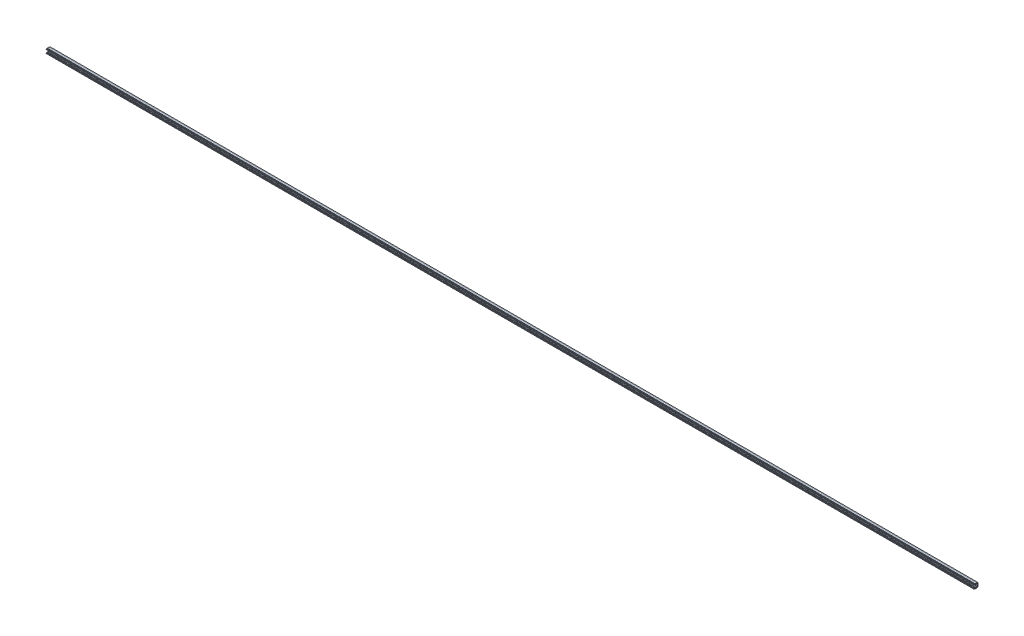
ISO-10303-21;
HEADER;
FILE_DESCRIPTION(('STEP AP214'),'2;1');
FILE_NAME('part.step','',(''),(''),'','','');
FILE_SCHEMA(('AUTOMOTIVE_DESIGN { 1 0 10303 214 1 1 1 1 }'));
ENDSEC;
DATA;
#1=APPLICATION_CONTEXT('core data for automotive mechanical design processes');
#2=APPLICATION_PROTOCOL_DEFINITION('international standard','automotive_design',2000,#1);
#3=PRODUCT_CONTEXT('',#1,'mechanical');
#4=PRODUCT('Part','Part','',(#3));
#5=PRODUCT_RELATED_PRODUCT_CATEGORY('part','',(#4));
#6=PRODUCT_DEFINITION_FORMATION('','',#4);
#7=PRODUCT_DEFINITION_CONTEXT('part definition',#1,'design');
#8=PRODUCT_DEFINITION('design','',#6,#7);
#9=PRODUCT_DEFINITION_SHAPE('','',#8);
#10=(LENGTH_UNIT() NAMED_UNIT(*) SI_UNIT(.MILLI.,.METRE.));
#11=(NAMED_UNIT(*) PLANE_ANGLE_UNIT() SI_UNIT($,.RADIAN.));
#12=(NAMED_UNIT(*) SI_UNIT($,.STERADIAN.) SOLID_ANGLE_UNIT());
#13=UNCERTAINTY_MEASURE_WITH_UNIT(LENGTH_MEASURE(1.E-05),#10,'distance_accuracy_value','');
#14=(GEOMETRIC_REPRESENTATION_CONTEXT(3) GLOBAL_UNCERTAINTY_ASSIGNED_CONTEXT((#13)) GLOBAL_UNIT_ASSIGNED_CONTEXT((#10,
#11,#12)) REPRESENTATION_CONTEXT('',''));
#15=CARTESIAN_POINT('',(0.,0.,0.));
#16=DIRECTION('',(0.,0.,1.));
#17=DIRECTION('',(1.,0.,0.));
#18=AXIS2_PLACEMENT_3D('',#15,#16,#17);
#19=CARTESIAN_POINT('',(0.,3.27561598,-2.548298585));
#20=DIRECTION('',(0.,-0.091266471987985,0.995826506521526));
#21=DIRECTION('',(0.,-0.995826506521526,-0.091266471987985));
#22=AXIS2_PLACEMENT_3D('',#19,#20,#21);
#23=PLANE('',#22);
#24=DIRECTION('',(0.,-0.995826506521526,-0.091266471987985));
#25=VECTOR('',#24,1.);
#26=CARTESIAN_POINT('',(0.,3.27561598,-2.548298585));
#27=LINE('',#26,#25);
#28=CARTESIAN_POINT('',(0.,3.47995756,-2.52957089));
#29=VERTEX_POINT('',#28);
#30=CARTESIAN_POINT('',(0.,3.0712744,-2.56702628));
#31=VERTEX_POINT('',#30);
#32=EDGE_CURVE('E377',#29,#31,#27,.T.);
#33=ORIENTED_EDGE('',*,*,#32,.T.);
#34=DIRECTION('',(1.,0.,0.));
#35=VECTOR('',#34,1.);
#36=CARTESIAN_POINT('',(0.,3.0712744,-2.56702628));
#37=LINE('',#36,#35);
#38=CARTESIAN_POINT('',(2000.,3.0712744,-2.56702628));
#39=VERTEX_POINT('',#38);
#40=EDGE_CURVE('E390',#39,#31,#37,.F.);
#41=ORIENTED_EDGE('',*,*,#40,.F.);
#42=DIRECTION('',(0.,-0.995826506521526,-0.091266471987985));
#43=VECTOR('',#42,1.);
#44=CARTESIAN_POINT('',(2000.,3.27561598,-2.548298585));
#45=LINE('',#44,#43);
#46=CARTESIAN_POINT('',(2000.,3.47995756,-2.52957089));
#47=VERTEX_POINT('',#46);
#48=EDGE_CURVE('E18',#39,#47,#45,.F.);
#49=ORIENTED_EDGE('',*,*,#48,.T.);
#50=DIRECTION('',(1.,0.,0.));
#51=VECTOR('',#50,1.);
#52=CARTESIAN_POINT('',(0.,3.47995756,-2.52957089));
#53=LINE('',#52,#51);
#54=EDGE_CURVE('E434',#29,#47,#53,.T.);
#55=ORIENTED_EDGE('',*,*,#54,.F.);
#56=EDGE_LOOP('',(#33,#41,#49,#55));
#57=FACE_BOUND('',#56,.T.);
#58=ADVANCED_FACE('F15',(#57),#23,.T.);
#59=CARTESIAN_POINT('',(0.,-3.27561603,-2.548298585));
#60=DIRECTION('',(0.,0.091266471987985,0.995826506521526));
#61=DIRECTION('',(0.,-0.995826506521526,0.091266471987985));
#62=AXIS2_PLACEMENT_3D('',#59,#60,#61);
#63=PLANE('',#62);
#64=DIRECTION('',(0.,-0.995826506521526,0.091266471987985));
#65=VECTOR('',#64,1.);
#66=CARTESIAN_POINT('',(0.,-3.27561603,-2.548298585));
#67=LINE('',#66,#65);
#68=CARTESIAN_POINT('',(0.,-3.07127445,-2.56702628));
#69=VERTEX_POINT('',#68);
#70=CARTESIAN_POINT('',(0.,-3.47995761,-2.52957089));
#71=VERTEX_POINT('',#70);
#72=EDGE_CURVE('E398',#69,#71,#67,.T.);
#73=ORIENTED_EDGE('',*,*,#72,.T.);
#74=DIRECTION('',(1.,0.,0.));
#75=VECTOR('',#74,1.);
#76=CARTESIAN_POINT('',(0.,-3.47995761,-2.52957089));
#77=LINE('',#76,#75);
#78=CARTESIAN_POINT('',(2000.,-3.47995761,-2.52957089));
#79=VERTEX_POINT('',#78);
#80=EDGE_CURVE('E413',#79,#71,#77,.F.);
#81=ORIENTED_EDGE('',*,*,#80,.F.);
#82=DIRECTION('',(0.,-0.995826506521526,0.091266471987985));
#83=VECTOR('',#82,1.);
#84=CARTESIAN_POINT('',(2000.,-3.27561603,-2.548298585));
#85=LINE('',#84,#83);
#86=CARTESIAN_POINT('',(2000.,-3.07127445,-2.56702628));
#87=VERTEX_POINT('',#86);
#88=EDGE_CURVE('E400',#79,#87,#85,.F.);
#89=ORIENTED_EDGE('',*,*,#88,.T.);
#90=DIRECTION('',(1.,0.,0.));
#91=VECTOR('',#90,1.);
#92=CARTESIAN_POINT('',(0.,-3.07127445,-2.56702628));
#93=LINE('',#92,#91);
#94=EDGE_CURVE('E410',#69,#87,#93,.T.);
#95=ORIENTED_EDGE('',*,*,#94,.F.);
#96=EDGE_LOOP('',(#73,#81,#89,#95));
#97=FACE_BOUND('',#96,.T.);
#98=ADVANCED_FACE('F409',(#97),#63,.T.);
#99=CARTESIAN_POINT('',(0.,2.64225045,-3.08262381));
#100=DIRECTION('',(0.,-0.768690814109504,0.6396205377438));
#101=DIRECTION('',(0.,-0.6396205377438,-0.768690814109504));
#102=AXIS2_PLACEMENT_3D('',#99,#100,#101);
#103=PLANE('',#102);
#104=DIRECTION('',(0.,-0.6396205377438,-0.768690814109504));
#105=VECTOR('',#104,1.);
#106=CARTESIAN_POINT('',(0.,2.64225045,-3.08262381));
#107=LINE('',#106,#105);
#108=CARTESIAN_POINT('',(0.,2.2132265,-3.59822134));
#109=VERTEX_POINT('',#108);
#110=EDGE_CURVE('E392',#31,#109,#107,.T.);
#111=ORIENTED_EDGE('',*,*,#110,.T.);
#112=DIRECTION('',(1.,0.,0.));
#113=VECTOR('',#112,1.);
#114=CARTESIAN_POINT('',(0.,2.2132265,-3.59822134));
#115=LINE('',#114,#113);
#116=CARTESIAN_POINT('',(2000.,2.2132265,-3.59822134));
#117=VERTEX_POINT('',#116);
#118=EDGE_CURVE('E396',#117,#109,#115,.F.);
#119=ORIENTED_EDGE('',*,*,#118,.F.);
#120=DIRECTION('',(0.,-0.6396205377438,-0.768690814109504));
#121=VECTOR('',#120,1.);
#122=CARTESIAN_POINT('',(2000.,2.64225045,-3.08262381));
#123=LINE('',#122,#121);
#124=EDGE_CURVE('E384',#117,#39,#123,.F.);
#125=ORIENTED_EDGE('',*,*,#124,.T.);
#126=ORIENTED_EDGE('',*,*,#40,.T.);
#127=EDGE_LOOP('',(#111,#119,#125,#126));
#128=FACE_BOUND('',#127,.T.);
#129=ADVANCED_FACE('F394',(#128),#103,.T.);
#130=CARTESIAN_POINT('',(0.,3.51832761,-2.459618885));
#131=DIRECTION('',(0.,-0.876763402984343,0.480921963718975));
#132=DIRECTION('',(0.,-0.480921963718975,-0.876763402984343));
#133=AXIS2_PLACEMENT_3D('',#130,#131,#132);
#134=PLANE('',#133);
#135=DIRECTION('',(0.,-0.480921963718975,-0.876763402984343));
#136=VECTOR('',#135,1.);
#137=CARTESIAN_POINT('',(0.,3.51832761,-2.459618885));
#138=LINE('',#137,#136);
#139=CARTESIAN_POINT('',(0.,3.55669766,-2.38966688));
#140=VERTEX_POINT('',#139);
#141=EDGE_CURVE('E436',#140,#29,#138,.T.);
#142=ORIENTED_EDGE('',*,*,#141,.T.);
#143=ORIENTED_EDGE('',*,*,#54,.T.);
#144=DIRECTION('',(0.,-0.480921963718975,-0.876763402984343));
#145=VECTOR('',#144,1.);
#146=CARTESIAN_POINT('',(2000.,3.51832761,-2.459618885));
#147=LINE('',#146,#145);
#148=CARTESIAN_POINT('',(2000.,3.55669766,-2.38966688));
#149=VERTEX_POINT('',#148);
#150=EDGE_CURVE('E387',#47,#149,#147,.F.);
#151=ORIENTED_EDGE('',*,*,#150,.T.);
#152=DIRECTION('',(1.,0.,0.));
#153=VECTOR('',#152,1.);
#154=CARTESIAN_POINT('',(0.,3.55669766,-2.38966688));
#155=LINE('',#154,#153);
#156=EDGE_CURVE('E458',#140,#149,#155,.T.);
#157=ORIENTED_EDGE('',*,*,#156,.F.);
#158=EDGE_LOOP('',(#142,#143,#151,#157));
#159=FACE_BOUND('',#158,.T.);
#160=ADVANCED_FACE('F978',(#159),#134,.T.);
#161=CARTESIAN_POINT('',(0.,-3.51832766,-2.459618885));
#162=DIRECTION('',(0.,0.876763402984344,0.480921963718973));
#163=DIRECTION('',(0.,-0.480921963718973,0.876763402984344));
#164=AXIS2_PLACEMENT_3D('',#161,#162,#163);
#165=PLANE('',#164);
#166=DIRECTION('',(0.,-0.480921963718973,0.876763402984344));
#167=VECTOR('',#166,1.);
#168=CARTESIAN_POINT('',(0.,-3.51832766,-2.459618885));
#169=LINE('',#168,#167);
#170=CARTESIAN_POINT('',(0.,-3.55669771,-2.38966688));
#171=VERTEX_POINT('',#170);
#172=EDGE_CURVE('E429',#71,#171,#169,.T.);
#173=ORIENTED_EDGE('',*,*,#172,.T.);
#174=DIRECTION('',(1.,0.,0.));
#175=VECTOR('',#174,1.);
#176=CARTESIAN_POINT('',(0.,-3.55669771,-2.38966688));
#177=LINE('',#176,#175);
#178=CARTESIAN_POINT('',(2000.,-3.55669771,-2.38966688));
#179=VERTEX_POINT('',#178);
#180=EDGE_CURVE('E464',#179,#171,#177,.F.);
#181=ORIENTED_EDGE('',*,*,#180,.F.);
#182=DIRECTION('',(0.,-0.480921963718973,0.876763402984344));
#183=VECTOR('',#182,1.);
#184=CARTESIAN_POINT('',(2000.,-3.51832766,-2.459618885));
#185=LINE('',#184,#183);
#186=EDGE_CURVE('E432',#179,#79,#185,.F.);
#187=ORIENTED_EDGE('',*,*,#186,.T.);
#188=ORIENTED_EDGE('',*,*,#80,.T.);
#189=EDGE_LOOP('',(#173,#181,#187,#188));
#190=FACE_BOUND('',#189,.T.);
#191=ADVANCED_FACE('F936',(#190),#165,.T.);
#192=CARTESIAN_POINT('',(0.,-2.6422505,-3.08262381));
#193=DIRECTION('',(0.,0.768690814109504,0.6396205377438));
#194=DIRECTION('',(0.,-0.6396205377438,0.768690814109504));
#195=AXIS2_PLACEMENT_3D('',#192,#193,#194);
#196=PLANE('',#195);
#197=DIRECTION('',(0.,-0.6396205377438,0.768690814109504));
#198=VECTOR('',#197,1.);
#199=CARTESIAN_POINT('',(0.,-2.6422505,-3.08262381));
#200=LINE('',#199,#198);
#201=CARTESIAN_POINT('',(0.,-2.21322655,-3.59822134));
#202=VERTEX_POINT('',#201);
#203=EDGE_CURVE('E421',#202,#69,#200,.T.);
#204=ORIENTED_EDGE('',*,*,#203,.T.);
#205=ORIENTED_EDGE('',*,*,#94,.T.);
#206=DIRECTION('',(0.,-0.6396205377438,0.768690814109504));
#207=VECTOR('',#206,1.);
#208=CARTESIAN_POINT('',(2000.,-2.6422505,-3.08262381));
#209=LINE('',#208,#207);
#210=CARTESIAN_POINT('',(2000.,-2.21322655,-3.59822134));
#211=VERTEX_POINT('',#210);
#212=EDGE_CURVE('E419',#87,#211,#209,.F.);
#213=ORIENTED_EDGE('',*,*,#212,.T.);
#214=DIRECTION('',(1.,0.,0.));
#215=VECTOR('',#214,1.);
#216=CARTESIAN_POINT('',(0.,-2.21322655,-3.59822134));
#217=LINE('',#216,#215);
#218=EDGE_CURVE('E475',#202,#211,#217,.T.);
#219=ORIENTED_EDGE('',*,*,#218,.F.);
#220=EDGE_LOOP('',(#204,#205,#213,#219));
#221=FACE_BOUND('',#220,.T.);
#222=ADVANCED_FACE('F417',(#221),#196,.T.);
#223=CARTESIAN_POINT('',(0.,2.12799409,-4.093543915));
#224=DIRECTION('',(0.,-0.98551604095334,0.16958223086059));
#225=DIRECTION('',(0.,-0.16958223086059,-0.98551604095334));
#226=AXIS2_PLACEMENT_3D('',#223,#224,#225);
#227=PLANE('',#226);
#228=DIRECTION('',(0.,-0.16958223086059,-0.98551604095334));
#229=VECTOR('',#228,1.);
#230=CARTESIAN_POINT('',(0.,2.12799409,-4.093543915));
#231=LINE('',#230,#229);
#232=CARTESIAN_POINT('',(0.,2.04276168,-4.58886649));
#233=VERTEX_POINT('',#232);
#234=EDGE_CURVE('E441',#109,#233,#231,.T.);
#235=ORIENTED_EDGE('',*,*,#234,.T.);
#236=DIRECTION('',(1.,0.,0.));
#237=VECTOR('',#236,1.);
#238=CARTESIAN_POINT('',(0.,2.04276168,-4.58886649));
#239=LINE('',#238,#237);
#240=CARTESIAN_POINT('',(2000.,2.04276168,-4.58886649));
#241=VERTEX_POINT('',#240);
#242=EDGE_CURVE('E480',#241,#233,#239,.F.);
#243=ORIENTED_EDGE('',*,*,#242,.F.);
#244=DIRECTION('',(0.,-0.16958223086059,-0.98551604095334));
#245=VECTOR('',#244,1.);
#246=CARTESIAN_POINT('',(2000.,2.12799409,-4.093543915));
#247=LINE('',#246,#245);
#248=EDGE_CURVE('E422',#241,#117,#247,.F.);
#249=ORIENTED_EDGE('',*,*,#248,.T.);
#250=ORIENTED_EDGE('',*,*,#118,.T.);
#251=EDGE_LOOP('',(#235,#243,#249,#250));
#252=FACE_BOUND('',#251,.T.);
#253=ADVANCED_FACE('F451',(#252),#227,.T.);
#254=CARTESIAN_POINT('',(0.,3.45296685,-2.18843155));
#255=DIRECTION('',(0.,-0.888859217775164,-0.45818041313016));
#256=DIRECTION('',(0.,0.45818041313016,-0.888859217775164));
#257=AXIS2_PLACEMENT_3D('',#254,#255,#256);
#258=PLANE('',#257);
#259=DIRECTION('',(0.,0.45818041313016,-0.888859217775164));
#260=VECTOR('',#259,1.);
#261=CARTESIAN_POINT('',(0.,3.45296685,-2.18843155));
#262=LINE('',#261,#260);
#263=CARTESIAN_POINT('',(0.,3.34923604,-1.98719622));
#264=VERTEX_POINT('',#263);
#265=EDGE_CURVE('E455',#264,#140,#262,.T.);
#266=ORIENTED_EDGE('',*,*,#265,.T.);
#267=ORIENTED_EDGE('',*,*,#156,.T.);
#268=DIRECTION('',(0.,0.45818041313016,-0.888859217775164));
#269=VECTOR('',#268,1.);
#270=CARTESIAN_POINT('',(2000.,3.45296685,-2.18843155));
#271=LINE('',#270,#269);
#272=CARTESIAN_POINT('',(2000.,3.34923604,-1.98719622));
#273=VERTEX_POINT('',#272);
#274=EDGE_CURVE('E449',#149,#273,#271,.F.);
#275=ORIENTED_EDGE('',*,*,#274,.T.);
#276=DIRECTION('',(1.,0.,0.));
#277=VECTOR('',#276,1.);
#278=CARTESIAN_POINT('',(0.,3.34923604,-1.98719622));
#279=LINE('',#278,#277);
#280=EDGE_CURVE('E489',#264,#273,#279,.T.);
#281=ORIENTED_EDGE('',*,*,#280,.F.);
#282=EDGE_LOOP('',(#266,#267,#275,#281));
#283=FACE_BOUND('',#282,.T.);
#284=ADVANCED_FACE('F975',(#283),#258,.T.);
#285=CARTESIAN_POINT('',(0.,-3.4529669,-2.18843155));
#286=DIRECTION('',(0.,0.888859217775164,-0.45818041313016));
#287=DIRECTION('',(0.,0.45818041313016,0.888859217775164));
#288=AXIS2_PLACEMENT_3D('',#285,#286,#287);
#289=PLANE('',#288);
#290=DIRECTION('',(0.,0.45818041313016,0.888859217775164));
#291=VECTOR('',#290,1.);
#292=CARTESIAN_POINT('',(0.,-3.4529669,-2.18843155));
#293=LINE('',#292,#291);
#294=CARTESIAN_POINT('',(0.,-3.34923609,-1.98719622));
#295=VERTEX_POINT('',#294);
#296=EDGE_CURVE('E467',#171,#295,#293,.T.);
#297=ORIENTED_EDGE('',*,*,#296,.T.);
#298=DIRECTION('',(1.,0.,0.));
#299=VECTOR('',#298,1.);
#300=CARTESIAN_POINT('',(0.,-3.34923609,-1.98719622));
#301=LINE('',#300,#299);
#302=CARTESIAN_POINT('',(2000.,-3.34923609,-1.98719622));
#303=VERTEX_POINT('',#302);
#304=EDGE_CURVE('E495',#303,#295,#301,.F.);
#305=ORIENTED_EDGE('',*,*,#304,.F.);
#306=DIRECTION('',(0.,0.45818041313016,0.888859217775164));
#307=VECTOR('',#306,1.);
#308=CARTESIAN_POINT('',(2000.,-3.4529669,-2.18843155));
#309=LINE('',#308,#307);
#310=EDGE_CURVE('E461',#303,#179,#309,.F.);
#311=ORIENTED_EDGE('',*,*,#310,.T.);
#312=ORIENTED_EDGE('',*,*,#180,.T.);
#313=EDGE_LOOP('',(#297,#305,#311,#312));
#314=FACE_BOUND('',#313,.T.);
#315=ADVANCED_FACE('F932',(#314),#289,.T.);
#316=CARTESIAN_POINT('',(0.,-2.12799414,-4.093543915));
#317=DIRECTION('',(0.,0.98551604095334,0.16958223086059));
#318=DIRECTION('',(0.,-0.16958223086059,0.98551604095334));
#319=AXIS2_PLACEMENT_3D('',#316,#317,#318);
#320=PLANE('',#319);
#321=DIRECTION('',(0.,-0.16958223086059,0.98551604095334));
#322=VECTOR('',#321,1.);
#323=CARTESIAN_POINT('',(0.,-2.12799414,-4.093543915));
#324=LINE('',#323,#322);
#325=CARTESIAN_POINT('',(0.,-2.04276173,-4.58886649));
#326=VERTEX_POINT('',#325);
#327=EDGE_CURVE('E472',#326,#202,#324,.T.);
#328=ORIENTED_EDGE('',*,*,#327,.T.);
#329=ORIENTED_EDGE('',*,*,#218,.T.);
#330=DIRECTION('',(0.,-0.16958223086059,0.98551604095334));
#331=VECTOR('',#330,1.);
#332=CARTESIAN_POINT('',(2000.,-2.12799414,-4.093543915));
#333=LINE('',#332,#331);
#334=CARTESIAN_POINT('',(2000.,-2.04276173,-4.58886649));
#335=VERTEX_POINT('',#334);
#336=EDGE_CURVE('E469',#211,#335,#333,.F.);
#337=ORIENTED_EDGE('',*,*,#336,.T.);
#338=DIRECTION('',(1.,0.,0.));
#339=VECTOR('',#338,1.);
#340=CARTESIAN_POINT('',(0.,-2.04276173,-4.58886649));
#341=LINE('',#340,#339);
#342=EDGE_CURVE('E506',#326,#335,#341,.T.);
#343=ORIENTED_EDGE('',*,*,#342,.F.);
#344=EDGE_LOOP('',(#328,#329,#337,#343));
#345=FACE_BOUND('',#344,.T.);
#346=ADVANCED_FACE('F1140',(#345),#320,.T.);
#347=CARTESIAN_POINT('',(0.,2.02626051,-4.930717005));
#348=DIRECTION('',(0.,-0.998837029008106,0.048213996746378));
#349=DIRECTION('',(0.,-0.048213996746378,-0.998837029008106));
#350=AXIS2_PLACEMENT_3D('',#347,#348,#349);
#351=PLANE('',#350);
#352=DIRECTION('',(0.,-0.048213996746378,-0.998837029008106));
#353=VECTOR('',#352,1.);
#354=CARTESIAN_POINT('',(0.,2.02626051,-4.930717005));
#355=LINE('',#354,#353);
#356=CARTESIAN_POINT('',(0.,2.00975934,-5.27256752));
#357=VERTEX_POINT('',#356);
#358=EDGE_CURVE('E445',#233,#357,#355,.T.);
#359=ORIENTED_EDGE('',*,*,#358,.T.);
#360=DIRECTION('',(1.,0.,0.));
#361=VECTOR('',#360,1.);
#362=CARTESIAN_POINT('',(0.,2.00975934,-5.27256752));
#363=LINE('',#362,#361);
#364=CARTESIAN_POINT('',(2000.,2.00975934,-5.27256752));
#365=VERTEX_POINT('',#364);
#366=EDGE_CURVE('E512',#365,#357,#363,.F.);
#367=ORIENTED_EDGE('',*,*,#366,.F.);
#368=DIRECTION('',(0.,-0.048213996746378,-0.998837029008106));
#369=VECTOR('',#368,1.);
#370=CARTESIAN_POINT('',(2000.,2.02626051,-4.930717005));
#371=LINE('',#370,#369);
#372=EDGE_CURVE('E477',#365,#241,#371,.F.);
#373=ORIENTED_EDGE('',*,*,#372,.T.);
#374=ORIENTED_EDGE('',*,*,#242,.T.);
#375=EDGE_LOOP('',(#359,#367,#373,#374));
#376=FACE_BOUND('',#375,.T.);
#377=ADVANCED_FACE('F1137',(#376),#351,.T.);
#378=CARTESIAN_POINT('',(0.,3.34980591,-1.160222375));
#379=DIRECTION('',(0.,-0.999999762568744,0.000689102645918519));
#380=DIRECTION('',(0.,-0.000689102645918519,-0.999999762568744));
#381=AXIS2_PLACEMENT_3D('',#378,#379,#380);
#382=PLANE('',#381);
#383=DIRECTION('',(0.,-0.000689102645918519,-0.999999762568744));
#384=VECTOR('',#383,1.);
#385=CARTESIAN_POINT('',(0.,3.34980591,-1.160222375));
#386=LINE('',#385,#384);
#387=CARTESIAN_POINT('',(0.,3.35037578,-0.33324853));
#388=VERTEX_POINT('',#387);
#389=EDGE_CURVE('E486',#388,#264,#386,.T.);
#390=ORIENTED_EDGE('',*,*,#389,.T.);
#391=ORIENTED_EDGE('',*,*,#280,.T.);
#392=DIRECTION('',(0.,-0.000689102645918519,-0.999999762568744));
#393=VECTOR('',#392,1.);
#394=CARTESIAN_POINT('',(2000.,3.34980591,-1.160222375));
#395=LINE('',#394,#393);
#396=CARTESIAN_POINT('',(2000.,3.35037578,-0.33324853));
#397=VERTEX_POINT('',#396);
#398=EDGE_CURVE('E483',#273,#397,#395,.F.);
#399=ORIENTED_EDGE('',*,*,#398,.T.);
#400=DIRECTION('',(1.,0.,0.));
#401=VECTOR('',#400,1.);
#402=CARTESIAN_POINT('',(0.,3.35037578,-0.33324853));
#403=LINE('',#402,#401);
#404=EDGE_CURVE('E523',#388,#397,#403,.T.);
#405=ORIENTED_EDGE('',*,*,#404,.F.);
#406=EDGE_LOOP('',(#390,#391,#399,#405));
#407=FACE_BOUND('',#406,.T.);
#408=ADVANCED_FACE('F972',(#407),#382,.T.);
#409=CARTESIAN_POINT('',(0.,-3.34980596,-1.160222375));
#410=DIRECTION('',(0.,0.999999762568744,0.000689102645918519));
#411=DIRECTION('',(0.,-0.000689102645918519,0.999999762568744));
#412=AXIS2_PLACEMENT_3D('',#409,#410,#411);
#413=PLANE('',#412);
#414=DIRECTION('',(0.,-0.000689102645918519,0.999999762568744));
#415=VECTOR('',#414,1.);
#416=CARTESIAN_POINT('',(0.,-3.34980596,-1.160222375));
#417=LINE('',#416,#415);
#418=CARTESIAN_POINT('',(0.,-3.35037583,-0.33324853));
#419=VERTEX_POINT('',#418);
#420=EDGE_CURVE('E498',#295,#419,#417,.T.);
#421=ORIENTED_EDGE('',*,*,#420,.T.);
#422=DIRECTION('',(1.,0.,0.));
#423=VECTOR('',#422,1.);
#424=CARTESIAN_POINT('',(0.,-3.35037583,-0.33324853));
#425=LINE('',#424,#423);
#426=CARTESIAN_POINT('',(2000.,-3.35037583,-0.33324853));
#427=VERTEX_POINT('',#426);
#428=EDGE_CURVE('E530',#427,#419,#425,.F.);
#429=ORIENTED_EDGE('',*,*,#428,.F.);
#430=DIRECTION('',(0.,-0.000689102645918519,0.999999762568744));
#431=VECTOR('',#430,1.);
#432=CARTESIAN_POINT('',(2000.,-3.34980596,-1.160222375));
#433=LINE('',#432,#431);
#434=EDGE_CURVE('E492',#427,#303,#433,.F.);
#435=ORIENTED_EDGE('',*,*,#434,.T.);
#436=ORIENTED_EDGE('',*,*,#304,.T.);
#437=EDGE_LOOP('',(#421,#429,#435,#436));
#438=FACE_BOUND('',#437,.T.);
#439=ADVANCED_FACE('F929',(#438),#413,.T.);
#440=CARTESIAN_POINT('',(0.,-2.02626056,-4.930717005));
#441=DIRECTION('',(0.,0.998837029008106,0.048213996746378));
#442=DIRECTION('',(0.,-0.048213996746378,0.998837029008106));
#443=AXIS2_PLACEMENT_3D('',#440,#441,#442);
#444=PLANE('',#443);
#445=DIRECTION('',(0.,-0.048213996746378,0.998837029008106));
#446=VECTOR('',#445,1.);
#447=CARTESIAN_POINT('',(0.,-2.02626056,-4.930717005));
#448=LINE('',#447,#446);
#449=CARTESIAN_POINT('',(0.,-2.00975939,-5.27256752));
#450=VERTEX_POINT('',#449);
#451=EDGE_CURVE('E503',#450,#326,#448,.T.);
#452=ORIENTED_EDGE('',*,*,#451,.T.);
#453=ORIENTED_EDGE('',*,*,#342,.T.);
#454=DIRECTION('',(0.,-0.048213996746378,0.998837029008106));
#455=VECTOR('',#454,1.);
#456=CARTESIAN_POINT('',(2000.,-2.02626056,-4.930717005));
#457=LINE('',#456,#455);
#458=CARTESIAN_POINT('',(2000.,-2.00975939,-5.27256752));
#459=VERTEX_POINT('',#458);
#460=EDGE_CURVE('E500',#335,#459,#457,.F.);
#461=ORIENTED_EDGE('',*,*,#460,.T.);
#462=DIRECTION('',(1.,0.,0.));
#463=VECTOR('',#462,1.);
#464=CARTESIAN_POINT('',(0.,-2.00975939,-5.27256752));
#465=LINE('',#464,#463);
#466=EDGE_CURVE('E541',#450,#459,#465,.T.);
#467=ORIENTED_EDGE('',*,*,#466,.F.);
#468=EDGE_LOOP('',(#452,#453,#461,#467));
#469=FACE_BOUND('',#468,.T.);
#470=ADVANCED_FACE('F1128',(#469),#444,.T.);
#471=CARTESIAN_POINT('',(0.,2.10042325,-5.38051452));
#472=DIRECTION('',(0.,-0.765745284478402,-0.643143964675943));
#473=DIRECTION('',(0.,0.643143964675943,-0.765745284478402));
#474=AXIS2_PLACEMENT_3D('',#471,#472,#473);
#475=PLANE('',#474);
#476=DIRECTION('',(0.,0.643143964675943,-0.765745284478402));
#477=VECTOR('',#476,1.);
#478=CARTESIAN_POINT('',(0.,2.10042325,-5.38051452));
#479=LINE('',#478,#477);
#480=CARTESIAN_POINT('',(0.,2.19108716,-5.48846152));
#481=VERTEX_POINT('',#480);
#482=EDGE_CURVE('E515',#357,#481,#479,.T.);
#483=ORIENTED_EDGE('',*,*,#482,.T.);
#484=DIRECTION('',(1.,0.,0.));
#485=VECTOR('',#484,1.);
#486=CARTESIAN_POINT('',(0.,2.19108716,-5.48846152));
#487=LINE('',#486,#485);
#488=CARTESIAN_POINT('',(2000.,2.19108716,-5.48846152));
#489=VERTEX_POINT('',#488);
#490=EDGE_CURVE('E547',#489,#481,#487,.F.);
#491=ORIENTED_EDGE('',*,*,#490,.F.);
#492=DIRECTION('',(0.,0.643143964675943,-0.765745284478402));
#493=VECTOR('',#492,1.);
#494=CARTESIAN_POINT('',(2000.,2.10042325,-5.38051452));
#495=LINE('',#494,#493);
#496=EDGE_CURVE('E509',#489,#365,#495,.F.);
#497=ORIENTED_EDGE('',*,*,#496,.T.);
#498=ORIENTED_EDGE('',*,*,#366,.T.);
#499=EDGE_LOOP('',(#483,#491,#497,#498));
#500=FACE_BOUND('',#499,.T.);
#501=ADVANCED_FACE('F1125',(#500),#475,.T.);
#502=CARTESIAN_POINT('',(0.,3.45295902,-0.230806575));
#503=DIRECTION('',(0.,-0.706619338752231,0.707593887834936));
#504=DIRECTION('',(0.,-0.707593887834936,-0.706619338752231));
#505=AXIS2_PLACEMENT_3D('',#502,#503,#504);
#506=PLANE('',#505);
#507=DIRECTION('',(0.,-0.707593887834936,-0.706619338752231));
#508=VECTOR('',#507,1.);
#509=CARTESIAN_POINT('',(0.,3.45295902,-0.230806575));
#510=LINE('',#509,#508);
#511=CARTESIAN_POINT('',(0.,3.55554226,-0.12836462));
#512=VERTEX_POINT('',#511);
#513=EDGE_CURVE('E520',#512,#388,#510,.T.);
#514=ORIENTED_EDGE('',*,*,#513,.T.);
#515=ORIENTED_EDGE('',*,*,#404,.T.);
#516=DIRECTION('',(0.,-0.707593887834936,-0.706619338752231));
#517=VECTOR('',#516,1.);
#518=CARTESIAN_POINT('',(2000.,3.45295902,-0.230806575));
#519=LINE('',#518,#517);
#520=CARTESIAN_POINT('',(2000.,3.55554226,-0.12836462));
#521=VERTEX_POINT('',#520);
#522=EDGE_CURVE('E517',#397,#521,#519,.F.);
#523=ORIENTED_EDGE('',*,*,#522,.T.);
#524=DIRECTION('',(1.,0.,0.));
#525=VECTOR('',#524,1.);
#526=CARTESIAN_POINT('',(0.,3.55554226,-0.12836462));
#527=LINE('',#526,#525);
#528=EDGE_CURVE('E558',#512,#521,#527,.T.);
#529=ORIENTED_EDGE('',*,*,#528,.F.);
#530=EDGE_LOOP('',(#514,#515,#523,#529));
#531=FACE_BOUND('',#530,.T.);
#532=ADVANCED_FACE('F969',(#531),#506,.T.);
#533=CARTESIAN_POINT('',(0.,-3.45295907,-0.230806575));
#534=DIRECTION('',(0.,0.706619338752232,0.707593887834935));
#535=DIRECTION('',(0.,-0.707593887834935,0.706619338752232));
#536=AXIS2_PLACEMENT_3D('',#533,#534,#535);
#537=PLANE('',#536);
#538=DIRECTION('',(0.,-0.707593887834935,0.706619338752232));
#539=VECTOR('',#538,1.);
#540=CARTESIAN_POINT('',(0.,-3.45295907,-0.230806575));
#541=LINE('',#540,#539);
#542=CARTESIAN_POINT('',(0.,-3.55554231,-0.12836462));
#543=VERTEX_POINT('',#542);
#544=EDGE_CURVE('E533',#419,#543,#541,.T.);
#545=ORIENTED_EDGE('',*,*,#544,.T.);
#546=DIRECTION('',(1.,0.,0.));
#547=VECTOR('',#546,1.);
#548=CARTESIAN_POINT('',(0.,-3.55554231,-0.12836462));
#549=LINE('',#548,#547);
#550=CARTESIAN_POINT('',(2000.,-3.55554231,-0.12836462));
#551=VERTEX_POINT('',#550);
#552=EDGE_CURVE('E565',#551,#543,#549,.F.);
#553=ORIENTED_EDGE('',*,*,#552,.F.);
#554=DIRECTION('',(0.,-0.707593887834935,0.706619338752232));
#555=VECTOR('',#554,1.);
#556=CARTESIAN_POINT('',(2000.,-3.45295907,-0.230806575));
#557=LINE('',#556,#555);
#558=EDGE_CURVE('E527',#551,#427,#557,.F.);
#559=ORIENTED_EDGE('',*,*,#558,.T.);
#560=ORIENTED_EDGE('',*,*,#428,.T.);
#561=EDGE_LOOP('',(#545,#553,#559,#560));
#562=FACE_BOUND('',#561,.T.);
#563=ADVANCED_FACE('F927',(#562),#537,.T.);
#564=CARTESIAN_POINT('',(0.,-2.1004233,-5.38051452));
#565=DIRECTION('',(0.,0.765745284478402,-0.643143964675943));
#566=DIRECTION('',(0.,0.643143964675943,0.765745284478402));
#567=AXIS2_PLACEMENT_3D('',#564,#565,#566);
#568=PLANE('',#567);
#569=DIRECTION('',(0.,0.643143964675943,0.765745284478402));
#570=VECTOR('',#569,1.);
#571=CARTESIAN_POINT('',(0.,-2.1004233,-5.38051452));
#572=LINE('',#571,#570);
#573=CARTESIAN_POINT('',(0.,-2.19108721,-5.48846152));
#574=VERTEX_POINT('',#573);
#575=EDGE_CURVE('E538',#574,#450,#572,.T.);
#576=ORIENTED_EDGE('',*,*,#575,.T.);
#577=ORIENTED_EDGE('',*,*,#466,.T.);
#578=DIRECTION('',(0.,0.643143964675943,0.765745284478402));
#579=VECTOR('',#578,1.);
#580=CARTESIAN_POINT('',(2000.,-2.1004233,-5.38051452));
#581=LINE('',#580,#579);
#582=CARTESIAN_POINT('',(2000.,-2.19108721,-5.48846152));
#583=VERTEX_POINT('',#582);
#584=EDGE_CURVE('E535',#459,#583,#581,.F.);
#585=ORIENTED_EDGE('',*,*,#584,.T.);
#586=DIRECTION('',(1.,0.,0.));
#587=VECTOR('',#586,1.);
#588=CARTESIAN_POINT('',(0.,-2.19108721,-5.48846152));
#589=LINE('',#588,#587);
#590=EDGE_CURVE('E576',#574,#583,#589,.T.);
#591=ORIENTED_EDGE('',*,*,#590,.F.);
#592=EDGE_LOOP('',(#576,#577,#585,#591));
#593=FACE_BOUND('',#592,.T.);
#594=ADVANCED_FACE('F1116',(#593),#568,.T.);
#595=CARTESIAN_POINT('',(0.,2.3355161,-5.501029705));
#596=DIRECTION('',(0.,-0.0866922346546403,-0.99623514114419));
#597=DIRECTION('',(0.,0.99623514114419,-0.0866922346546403));
#598=AXIS2_PLACEMENT_3D('',#595,#596,#597);
#599=PLANE('',#598);
#600=DIRECTION('',(0.,0.99623514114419,-0.0866922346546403));
#601=VECTOR('',#600,1.);
#602=CARTESIAN_POINT('',(0.,2.3355161,-5.501029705));
#603=LINE('',#602,#601);
#604=CARTESIAN_POINT('',(0.,2.47994504,-5.51359789));
#605=VERTEX_POINT('',#604);
#606=EDGE_CURVE('E550',#481,#605,#603,.T.);
#607=ORIENTED_EDGE('',*,*,#606,.T.);
#608=DIRECTION('',(1.,0.,0.));
#609=VECTOR('',#608,1.);
#610=CARTESIAN_POINT('',(0.,2.47994504,-5.51359789));
#611=LINE('',#610,#609);
#612=CARTESIAN_POINT('',(2000.,2.47994504,-5.51359789));
#613=VERTEX_POINT('',#612);
#614=EDGE_CURVE('E582',#613,#605,#611,.F.);
#615=ORIENTED_EDGE('',*,*,#614,.F.);
#616=DIRECTION('',(0.,0.99623514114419,-0.0866922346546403));
#617=VECTOR('',#616,1.);
#618=CARTESIAN_POINT('',(2000.,2.3355161,-5.501029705));
#619=LINE('',#618,#617);
#620=EDGE_CURVE('E544',#613,#489,#619,.F.);
#621=ORIENTED_EDGE('',*,*,#620,.T.);
#622=ORIENTED_EDGE('',*,*,#490,.T.);
#623=EDGE_LOOP('',(#607,#615,#621,#622));
#624=FACE_BOUND('',#623,.T.);
#625=ADVANCED_FACE('F1113',(#624),#599,.T.);
#626=CARTESIAN_POINT('',(0.,3.700516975,-0.12846452));
#627=DIRECTION('',(0.,0.0006890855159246,0.999999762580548));
#628=DIRECTION('',(0.,-0.999999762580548,0.0006890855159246));
#629=AXIS2_PLACEMENT_3D('',#626,#627,#628);
#630=PLANE('',#629);
#631=DIRECTION('',(0.,-0.999999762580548,0.0006890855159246));
#632=VECTOR('',#631,1.);
#633=CARTESIAN_POINT('',(0.,3.700516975,-0.12846452));
#634=LINE('',#633,#632);
#635=CARTESIAN_POINT('',(0.,3.84549169,-0.12856442));
#636=VERTEX_POINT('',#635);
#637=EDGE_CURVE('E555',#636,#512,#634,.T.);
#638=ORIENTED_EDGE('',*,*,#637,.T.);
#639=ORIENTED_EDGE('',*,*,#528,.T.);
#640=DIRECTION('',(0.,-0.999999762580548,0.0006890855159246));
#641=VECTOR('',#640,1.);
#642=CARTESIAN_POINT('',(2000.,3.700516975,-0.12846452));
#643=LINE('',#642,#641);
#644=CARTESIAN_POINT('',(2000.,3.84549169,-0.12856442));
#645=VERTEX_POINT('',#644);
#646=EDGE_CURVE('E552',#521,#645,#643,.F.);
#647=ORIENTED_EDGE('',*,*,#646,.T.);
#648=DIRECTION('',(1.,0.,0.));
#649=VECTOR('',#648,1.);
#650=CARTESIAN_POINT('',(0.,3.84549169,-0.12856442));
#651=LINE('',#650,#649);
#652=EDGE_CURVE('E593',#636,#645,#651,.T.);
#653=ORIENTED_EDGE('',*,*,#652,.F.);
#654=EDGE_LOOP('',(#638,#639,#647,#653));
#655=FACE_BOUND('',#654,.T.);
#656=ADVANCED_FACE('F966',(#655),#630,.T.);
#657=CARTESIAN_POINT('',(0.,-3.700517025,-0.12846452));
#658=DIRECTION('',(0.,-0.000689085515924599,0.999999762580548));
#659=DIRECTION('',(0.,-0.999999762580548,-0.000689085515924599));
#660=AXIS2_PLACEMENT_3D('',#657,#658,#659);
#661=PLANE('',#660);
#662=DIRECTION('',(0.,-0.999999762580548,-0.000689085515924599));
#663=VECTOR('',#662,1.);
#664=CARTESIAN_POINT('',(0.,-3.700517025,-0.12846452));
#665=LINE('',#664,#663);
#666=CARTESIAN_POINT('',(0.,-3.84549174,-0.12856442));
#667=VERTEX_POINT('',#666);
#668=EDGE_CURVE('E568',#543,#667,#665,.T.);
#669=ORIENTED_EDGE('',*,*,#668,.T.);
#670=DIRECTION('',(1.,0.,0.));
#671=VECTOR('',#670,1.);
#672=CARTESIAN_POINT('',(0.,-3.84549174,-0.12856442));
#673=LINE('',#672,#671);
#674=CARTESIAN_POINT('',(2000.,-3.84549174,-0.12856442));
#675=VERTEX_POINT('',#674);
#676=EDGE_CURVE('E600',#675,#667,#673,.F.);
#677=ORIENTED_EDGE('',*,*,#676,.F.);
#678=DIRECTION('',(0.,-0.999999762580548,-0.000689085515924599));
#679=VECTOR('',#678,1.);
#680=CARTESIAN_POINT('',(2000.,-3.700517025,-0.12846452));
#681=LINE('',#680,#679);
#682=EDGE_CURVE('E562',#675,#551,#681,.F.);
#683=ORIENTED_EDGE('',*,*,#682,.T.);
#684=ORIENTED_EDGE('',*,*,#552,.T.);
#685=EDGE_LOOP('',(#669,#677,#683,#684));
#686=FACE_BOUND('',#685,.T.);
#687=ADVANCED_FACE('F920',(#686),#661,.T.);
#688=CARTESIAN_POINT('',(0.,-2.33551615,-5.501029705));
#689=DIRECTION('',(0.,0.0866922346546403,-0.99623514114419));
#690=DIRECTION('',(0.,0.99623514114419,0.0866922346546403));
#691=AXIS2_PLACEMENT_3D('',#688,#689,#690);
#692=PLANE('',#691);
#693=DIRECTION('',(0.,0.99623514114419,0.0866922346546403));
#694=VECTOR('',#693,1.);
#695=CARTESIAN_POINT('',(0.,-2.33551615,-5.501029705));
#696=LINE('',#695,#694);
#697=CARTESIAN_POINT('',(0.,-2.47994509,-5.51359789));
#698=VERTEX_POINT('',#697);
#699=EDGE_CURVE('E573',#698,#574,#696,.T.);
#700=ORIENTED_EDGE('',*,*,#699,.T.);
#701=ORIENTED_EDGE('',*,*,#590,.T.);
#702=DIRECTION('',(0.,0.99623514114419,0.0866922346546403));
#703=VECTOR('',#702,1.);
#704=CARTESIAN_POINT('',(2000.,-2.33551615,-5.501029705));
#705=LINE('',#704,#703);
#706=CARTESIAN_POINT('',(2000.,-2.47994509,-5.51359789));
#707=VERTEX_POINT('',#706);
#708=EDGE_CURVE('E570',#583,#707,#705,.F.);
#709=ORIENTED_EDGE('',*,*,#708,.T.);
#710=DIRECTION('',(1.,0.,0.));
#711=VECTOR('',#710,1.);
#712=CARTESIAN_POINT('',(0.,-2.47994509,-5.51359789));
#713=LINE('',#712,#711);
#714=EDGE_CURVE('E611',#698,#707,#713,.T.);
#715=ORIENTED_EDGE('',*,*,#714,.F.);
#716=EDGE_LOOP('',(#700,#701,#709,#715));
#717=FACE_BOUND('',#716,.T.);
#718=ADVANCED_FACE('F1104',(#717),#692,.T.);
#719=CARTESIAN_POINT('',(0.,2.58971534,-5.421402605));
#720=DIRECTION('',(0.,0.643143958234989,-0.765745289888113));
#721=DIRECTION('',(0.,0.765745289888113,0.643143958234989));
#722=AXIS2_PLACEMENT_3D('',#719,#720,#721);
#723=PLANE('',#722);
#724=DIRECTION('',(0.,0.765745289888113,0.643143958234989));
#725=VECTOR('',#724,1.);
#726=CARTESIAN_POINT('',(0.,2.58971534,-5.421402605));
#727=LINE('',#726,#725);
#728=CARTESIAN_POINT('',(0.,2.69948564,-5.32920732));
#729=VERTEX_POINT('',#728);
#730=EDGE_CURVE('E585',#605,#729,#727,.T.);
#731=ORIENTED_EDGE('',*,*,#730,.T.);
#732=DIRECTION('',(1.,0.,0.));
#733=VECTOR('',#732,1.);
#734=CARTESIAN_POINT('',(0.,2.69948564,-5.32920732));
#735=LINE('',#734,#733);
#736=CARTESIAN_POINT('',(2000.,2.69948564,-5.32920732));
#737=VERTEX_POINT('',#736);
#738=EDGE_CURVE('E617',#737,#729,#735,.F.);
#739=ORIENTED_EDGE('',*,*,#738,.F.);
#740=DIRECTION('',(0.,0.765745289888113,0.643143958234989));
#741=VECTOR('',#740,1.);
#742=CARTESIAN_POINT('',(2000.,2.58971534,-5.421402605));
#743=LINE('',#742,#741);
#744=EDGE_CURVE('E579',#737,#613,#743,.F.);
#745=ORIENTED_EDGE('',*,*,#744,.T.);
#746=ORIENTED_EDGE('',*,*,#614,.T.);
#747=EDGE_LOOP('',(#731,#739,#745,#746));
#748=FACE_BOUND('',#747,.T.);
#749=ADVANCED_FACE('F1101',(#748),#723,.T.);
#750=CARTESIAN_POINT('',(0.,3.94793365,-0.231147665));
#751=DIRECTION('',(0.,0.707593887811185,0.706619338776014));
#752=DIRECTION('',(0.,-0.706619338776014,0.707593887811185));
#753=AXIS2_PLACEMENT_3D('',#750,#751,#752);
#754=PLANE('',#753);
#755=DIRECTION('',(0.,-0.706619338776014,0.707593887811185));
#756=VECTOR('',#755,1.);
#757=CARTESIAN_POINT('',(0.,3.94793365,-0.231147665));
#758=LINE('',#757,#756);
#759=CARTESIAN_POINT('',(0.,4.05037561,-0.33373091));
#760=VERTEX_POINT('',#759);
#761=EDGE_CURVE('E590',#760,#636,#758,.T.);
#762=ORIENTED_EDGE('',*,*,#761,.T.);
#763=ORIENTED_EDGE('',*,*,#652,.T.);
#764=DIRECTION('',(0.,-0.706619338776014,0.707593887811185));
#765=VECTOR('',#764,1.);
#766=CARTESIAN_POINT('',(2000.,3.94793365,-0.231147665));
#767=LINE('',#766,#765);
#768=CARTESIAN_POINT('',(2000.,4.05037561,-0.33373091));
#769=VERTEX_POINT('',#768);
#770=EDGE_CURVE('E587',#645,#769,#767,.F.);
#771=ORIENTED_EDGE('',*,*,#770,.T.);
#772=DIRECTION('',(1.,0.,0.));
#773=VECTOR('',#772,1.);
#774=CARTESIAN_POINT('',(0.,4.05037561,-0.33373091));
#775=LINE('',#774,#773);
#776=EDGE_CURVE('E628',#760,#769,#775,.T.);
#777=ORIENTED_EDGE('',*,*,#776,.F.);
#778=EDGE_LOOP('',(#762,#763,#771,#777));
#779=FACE_BOUND('',#778,.T.);
#780=ADVANCED_FACE('F963',(#779),#754,.T.);
#781=CARTESIAN_POINT('',(0.,-3.9479337,-0.231147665));
#782=DIRECTION('',(0.,-0.707593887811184,0.706619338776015));
#783=DIRECTION('',(0.,-0.706619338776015,-0.707593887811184));
#784=AXIS2_PLACEMENT_3D('',#781,#782,#783);
#785=PLANE('',#784);
#786=DIRECTION('',(0.,-0.706619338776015,-0.707593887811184));
#787=VECTOR('',#786,1.);
#788=CARTESIAN_POINT('',(0.,-3.9479337,-0.231147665));
#789=LINE('',#788,#787);
#790=CARTESIAN_POINT('',(0.,-4.05037566,-0.33373091));
#791=VERTEX_POINT('',#790);
#792=EDGE_CURVE('E603',#667,#791,#789,.T.);
#793=ORIENTED_EDGE('',*,*,#792,.T.);
#794=DIRECTION('',(1.,0.,0.));
#795=VECTOR('',#794,1.);
#796=CARTESIAN_POINT('',(0.,-4.05037566,-0.33373091));
#797=LINE('',#796,#795);
#798=CARTESIAN_POINT('',(2000.,-4.05037566,-0.33373091));
#799=VERTEX_POINT('',#798);
#800=EDGE_CURVE('E635',#799,#791,#797,.F.);
#801=ORIENTED_EDGE('',*,*,#800,.F.);
#802=DIRECTION('',(0.,-0.706619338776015,-0.707593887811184));
#803=VECTOR('',#802,1.);
#804=CARTESIAN_POINT('',(2000.,-3.9479337,-0.231147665));
#805=LINE('',#804,#803);
#806=EDGE_CURVE('E597',#799,#675,#805,.F.);
#807=ORIENTED_EDGE('',*,*,#806,.T.);
#808=ORIENTED_EDGE('',*,*,#676,.T.);
#809=EDGE_LOOP('',(#793,#801,#807,#808));
#810=FACE_BOUND('',#809,.T.);
#811=ADVANCED_FACE('F917',(#810),#785,.T.);
#812=CARTESIAN_POINT('',(0.,-2.58971539,-5.421402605));
#813=DIRECTION('',(0.,-0.643143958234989,-0.765745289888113));
#814=DIRECTION('',(0.,0.765745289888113,-0.643143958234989));
#815=AXIS2_PLACEMENT_3D('',#812,#813,#814);
#816=PLANE('',#815);
#817=DIRECTION('',(0.,0.765745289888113,-0.643143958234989));
#818=VECTOR('',#817,1.);
#819=CARTESIAN_POINT('',(0.,-2.58971539,-5.421402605));
#820=LINE('',#819,#818);
#821=CARTESIAN_POINT('',(0.,-2.69948569,-5.32920732));
#822=VERTEX_POINT('',#821);
#823=EDGE_CURVE('E608',#822,#698,#820,.T.);
#824=ORIENTED_EDGE('',*,*,#823,.T.);
#825=ORIENTED_EDGE('',*,*,#714,.T.);
#826=DIRECTION('',(0.,0.765745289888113,-0.643143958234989));
#827=VECTOR('',#826,1.);
#828=CARTESIAN_POINT('',(2000.,-2.58971539,-5.421402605));
#829=LINE('',#828,#827);
#830=CARTESIAN_POINT('',(2000.,-2.69948569,-5.32920732));
#831=VERTEX_POINT('',#830);
#832=EDGE_CURVE('E605',#707,#831,#829,.F.);
#833=ORIENTED_EDGE('',*,*,#832,.T.);
#834=DIRECTION('',(1.,0.,0.));
#835=VECTOR('',#834,1.);
#836=CARTESIAN_POINT('',(0.,-2.69948569,-5.32920732));
#837=LINE('',#836,#835);
#838=EDGE_CURVE('E646',#822,#831,#837,.T.);
#839=ORIENTED_EDGE('',*,*,#838,.F.);
#840=EDGE_LOOP('',(#824,#825,#833,#839));
#841=FACE_BOUND('',#840,.T.);
#842=ADVANCED_FACE('F1092',(#841),#816,.T.);
#843=CARTESIAN_POINT('',(0.,2.731565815,-5.00779292));
#844=DIRECTION('',(0.,0.995055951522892,-0.0993159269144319));
#845=DIRECTION('',(0.,0.0993159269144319,0.995055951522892));
#846=AXIS2_PLACEMENT_3D('',#843,#844,#845);
#847=PLANE('',#846);
#848=DIRECTION('',(0.,0.0993159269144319,0.995055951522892));
#849=VECTOR('',#848,1.);
#850=CARTESIAN_POINT('',(0.,2.731565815,-5.00779292));
#851=LINE('',#850,#849);
#852=CARTESIAN_POINT('',(0.,2.76364599,-4.68637852));
#853=VERTEX_POINT('',#852);
#854=EDGE_CURVE('E620',#729,#853,#851,.T.);
#855=ORIENTED_EDGE('',*,*,#854,.T.);
#856=DIRECTION('',(1.,0.,0.));
#857=VECTOR('',#856,1.);
#858=CARTESIAN_POINT('',(0.,2.76364599,-4.68637852));
#859=LINE('',#858,#857);
#860=CARTESIAN_POINT('',(2000.,2.76364599,-4.68637852));
#861=VERTEX_POINT('',#860);
#862=EDGE_CURVE('E652',#861,#853,#859,.F.);
#863=ORIENTED_EDGE('',*,*,#862,.F.);
#864=DIRECTION('',(0.,0.0993159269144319,0.995055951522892));
#865=VECTOR('',#864,1.);
#866=CARTESIAN_POINT('',(2000.,2.731565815,-5.00779292));
#867=LINE('',#866,#865);
#868=EDGE_CURVE('E614',#861,#737,#867,.F.);
#869=ORIENTED_EDGE('',*,*,#868,.T.);
#870=ORIENTED_EDGE('',*,*,#738,.T.);
#871=EDGE_LOOP('',(#855,#863,#869,#870));
#872=FACE_BOUND('',#871,.T.);
#873=ADVANCED_FACE('F1089',(#872),#847,.T.);
#874=CARTESIAN_POINT('',(0.,4.04986556,-1.07389523));
#875=DIRECTION('',(0.,0.999999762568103,-0.00068910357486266));
#876=DIRECTION('',(0.,0.00068910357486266,0.999999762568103));
#877=AXIS2_PLACEMENT_3D('',#874,#875,#876);
#878=PLANE('',#877);
#879=DIRECTION('',(0.,0.00068910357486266,0.999999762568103));
#880=VECTOR('',#879,1.);
#881=CARTESIAN_POINT('',(0.,4.04986556,-1.07389523));
#882=LINE('',#881,#880);
#883=CARTESIAN_POINT('',(0.,4.04935551,-1.81405955));
#884=VERTEX_POINT('',#883);
#885=EDGE_CURVE('E625',#884,#760,#882,.T.);
#886=ORIENTED_EDGE('',*,*,#885,.T.);
#887=ORIENTED_EDGE('',*,*,#776,.T.);
#888=DIRECTION('',(0.,0.00068910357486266,0.999999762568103));
#889=VECTOR('',#888,1.);
#890=CARTESIAN_POINT('',(2000.,4.04986556,-1.07389523));
#891=LINE('',#890,#889);
#892=CARTESIAN_POINT('',(2000.,4.04935551,-1.81405955));
#893=VERTEX_POINT('',#892);
#894=EDGE_CURVE('E622',#769,#893,#891,.F.);
#895=ORIENTED_EDGE('',*,*,#894,.T.);
#896=DIRECTION('',(1.,0.,0.));
#897=VECTOR('',#896,1.);
#898=CARTESIAN_POINT('',(0.,4.04935551,-1.81405955));
#899=LINE('',#898,#897);
#900=EDGE_CURVE('E663',#884,#893,#899,.T.);
#901=ORIENTED_EDGE('',*,*,#900,.F.);
#902=EDGE_LOOP('',(#886,#887,#895,#901));
#903=FACE_BOUND('',#902,.T.);
#904=ADVANCED_FACE('F960',(#903),#878,.T.);
#905=CARTESIAN_POINT('',(0.,-4.04986561,-1.07389523));
#906=DIRECTION('',(0.,-0.999999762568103,-0.00068910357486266));
#907=DIRECTION('',(0.,0.00068910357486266,-0.999999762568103));
#908=AXIS2_PLACEMENT_3D('',#905,#906,#907);
#909=PLANE('',#908);
#910=DIRECTION('',(0.,0.00068910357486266,-0.999999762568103));
#911=VECTOR('',#910,1.);
#912=CARTESIAN_POINT('',(0.,-4.04986561,-1.07389523));
#913=LINE('',#912,#911);
#914=CARTESIAN_POINT('',(0.,-4.04935556,-1.81405955));
#915=VERTEX_POINT('',#914);
#916=EDGE_CURVE('E638',#791,#915,#913,.T.);
#917=ORIENTED_EDGE('',*,*,#916,.T.);
#918=DIRECTION('',(1.,0.,0.));
#919=VECTOR('',#918,1.);
#920=CARTESIAN_POINT('',(0.,-4.04935556,-1.81405955));
#921=LINE('',#920,#919);
#922=CARTESIAN_POINT('',(2000.,-4.04935556,-1.81405955));
#923=VERTEX_POINT('',#922);
#924=EDGE_CURVE('E670',#923,#915,#921,.F.);
#925=ORIENTED_EDGE('',*,*,#924,.F.);
#926=DIRECTION('',(0.,0.00068910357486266,-0.999999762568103));
#927=VECTOR('',#926,1.);
#928=CARTESIAN_POINT('',(2000.,-4.04986561,-1.07389523));
#929=LINE('',#928,#927);
#930=EDGE_CURVE('E632',#923,#799,#929,.F.);
#931=ORIENTED_EDGE('',*,*,#930,.T.);
#932=ORIENTED_EDGE('',*,*,#800,.T.);
#933=EDGE_LOOP('',(#917,#925,#931,#932));
#934=FACE_BOUND('',#933,.T.);
#935=ADVANCED_FACE('F915',(#934),#909,.T.);
#936=CARTESIAN_POINT('',(0.,-2.731565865,-5.00779292));
#937=DIRECTION('',(0.,-0.995055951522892,-0.0993159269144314));
#938=DIRECTION('',(0.,0.0993159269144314,-0.995055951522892));
#939=AXIS2_PLACEMENT_3D('',#936,#937,#938);
#940=PLANE('',#939);
#941=DIRECTION('',(0.,0.0993159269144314,-0.995055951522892));
#942=VECTOR('',#941,1.);
#943=CARTESIAN_POINT('',(0.,-2.731565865,-5.00779292));
#944=LINE('',#943,#942);
#945=CARTESIAN_POINT('',(0.,-2.76364604,-4.68637852));
#946=VERTEX_POINT('',#945);
#947=EDGE_CURVE('E643',#946,#822,#944,.T.);
#948=ORIENTED_EDGE('',*,*,#947,.T.);
#949=ORIENTED_EDGE('',*,*,#838,.T.);
#950=DIRECTION('',(0.,0.0993159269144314,-0.995055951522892));
#951=VECTOR('',#950,1.);
#952=CARTESIAN_POINT('',(2000.,-2.731565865,-5.00779292));
#953=LINE('',#952,#951);
#954=CARTESIAN_POINT('',(2000.,-2.76364604,-4.68637852));
#955=VERTEX_POINT('',#954);
#956=EDGE_CURVE('E640',#831,#955,#953,.F.);
#957=ORIENTED_EDGE('',*,*,#956,.T.);
#958=DIRECTION('',(1.,0.,0.));
#959=VECTOR('',#958,1.);
#960=CARTESIAN_POINT('',(0.,-2.76364604,-4.68637852));
#961=LINE('',#960,#959);
#962=EDGE_CURVE('E681',#946,#955,#961,.T.);
#963=ORIENTED_EDGE('',*,*,#962,.F.);
#964=EDGE_LOOP('',(#948,#949,#957,#963));
#965=FACE_BOUND('',#964,.T.);
#966=ADVANCED_FACE('F1080',(#965),#940,.T.);
#967=CARTESIAN_POINT('',(0.,2.846606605,-4.31824664));
#968=DIRECTION('',(0.,0.975535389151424,-0.21984245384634));
#969=DIRECTION('',(0.,0.21984245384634,0.975535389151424));
#970=AXIS2_PLACEMENT_3D('',#967,#968,#969);
#971=PLANE('',#970);
#972=DIRECTION('',(0.,0.21984245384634,0.975535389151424));
#973=VECTOR('',#972,1.);
#974=CARTESIAN_POINT('',(0.,2.846606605,-4.31824664));
#975=LINE('',#974,#973);
#976=CARTESIAN_POINT('',(0.,2.92956722,-3.95011476));
#977=VERTEX_POINT('',#976);
#978=EDGE_CURVE('E655',#853,#977,#975,.T.);
#979=ORIENTED_EDGE('',*,*,#978,.T.);
#980=DIRECTION('',(1.,0.,0.));
#981=VECTOR('',#980,1.);
#982=CARTESIAN_POINT('',(0.,2.92956722,-3.95011476));
#983=LINE('',#982,#981);
#984=CARTESIAN_POINT('',(2000.,2.92956722,-3.95011476));
#985=VERTEX_POINT('',#984);
#986=EDGE_CURVE('E687',#985,#977,#983,.F.);
#987=ORIENTED_EDGE('',*,*,#986,.F.);
#988=DIRECTION('',(0.,0.21984245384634,0.975535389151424));
#989=VECTOR('',#988,1.);
#990=CARTESIAN_POINT('',(2000.,2.846606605,-4.31824664));
#991=LINE('',#990,#989);
#992=EDGE_CURVE('E649',#985,#861,#991,.F.);
#993=ORIENTED_EDGE('',*,*,#992,.T.);
#994=ORIENTED_EDGE('',*,*,#862,.T.);
#995=EDGE_LOOP('',(#979,#987,#993,#994));
#996=FACE_BOUND('',#995,.T.);
#997=ADVANCED_FACE('F1077',(#996),#971,.T.);
#998=CARTESIAN_POINT('',(0.,4.13947967,-1.992253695));
#999=DIRECTION('',(0.,0.892360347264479,0.451323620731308));
#1000=DIRECTION('',(0.,-0.451323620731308,0.892360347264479));
#1001=AXIS2_PLACEMENT_3D('',#998,#999,#1000);
#1002=PLANE('',#1001);
#1003=DIRECTION('',(0.,-0.451323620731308,0.892360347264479));
#1004=VECTOR('',#1003,1.);
#1005=CARTESIAN_POINT('',(0.,4.13947967,-1.992253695));
#1006=LINE('',#1005,#1004);
#1007=CARTESIAN_POINT('',(0.,4.22960383,-2.17044784));
#1008=VERTEX_POINT('',#1007);
#1009=EDGE_CURVE('E660',#1008,#884,#1006,.T.);
#1010=ORIENTED_EDGE('',*,*,#1009,.T.);
#1011=ORIENTED_EDGE('',*,*,#900,.T.);
#1012=DIRECTION('',(0.,-0.451323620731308,0.892360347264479));
#1013=VECTOR('',#1012,1.);
#1014=CARTESIAN_POINT('',(2000.,4.13947967,-1.992253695));
#1015=LINE('',#1014,#1013);
#1016=CARTESIAN_POINT('',(2000.,4.22960383,-2.17044784));
#1017=VERTEX_POINT('',#1016);
#1018=EDGE_CURVE('E657',#893,#1017,#1015,.F.);
#1019=ORIENTED_EDGE('',*,*,#1018,.T.);
#1020=DIRECTION('',(1.,0.,0.));
#1021=VECTOR('',#1020,1.);
#1022=CARTESIAN_POINT('',(0.,4.22960383,-2.17044784));
#1023=LINE('',#1022,#1021);
#1024=EDGE_CURVE('E698',#1008,#1017,#1023,.T.);
#1025=ORIENTED_EDGE('',*,*,#1024,.F.);
#1026=EDGE_LOOP('',(#1010,#1011,#1019,#1025));
#1027=FACE_BOUND('',#1026,.T.);
#1028=ADVANCED_FACE('F957',(#1027),#1002,.T.);
#1029=CARTESIAN_POINT('',(0.,-4.13947972,-1.992253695));
#1030=DIRECTION('',(0.,-0.89236034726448,0.451323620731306));
#1031=DIRECTION('',(0.,-0.451323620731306,-0.89236034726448));
#1032=AXIS2_PLACEMENT_3D('',#1029,#1030,#1031);
#1033=PLANE('',#1032);
#1034=DIRECTION('',(0.,-0.451323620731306,-0.89236034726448));
#1035=VECTOR('',#1034,1.);
#1036=CARTESIAN_POINT('',(0.,-4.13947972,-1.992253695));
#1037=LINE('',#1036,#1035);
#1038=CARTESIAN_POINT('',(0.,-4.22960388,-2.17044784));
#1039=VERTEX_POINT('',#1038);
#1040=EDGE_CURVE('E673',#915,#1039,#1037,.T.);
#1041=ORIENTED_EDGE('',*,*,#1040,.T.);
#1042=DIRECTION('',(1.,0.,0.));
#1043=VECTOR('',#1042,1.);
#1044=CARTESIAN_POINT('',(0.,-4.22960388,-2.17044784));
#1045=LINE('',#1044,#1043);
#1046=CARTESIAN_POINT('',(2000.,-4.22960388,-2.17044784));
#1047=VERTEX_POINT('',#1046);
#1048=EDGE_CURVE('E705',#1047,#1039,#1045,.F.);
#1049=ORIENTED_EDGE('',*,*,#1048,.F.);
#1050=DIRECTION('',(0.,-0.451323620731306,-0.89236034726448));
#1051=VECTOR('',#1050,1.);
#1052=CARTESIAN_POINT('',(2000.,-4.13947972,-1.992253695));
#1053=LINE('',#1052,#1051);
#1054=EDGE_CURVE('E667',#1047,#923,#1053,.F.);
#1055=ORIENTED_EDGE('',*,*,#1054,.T.);
#1056=ORIENTED_EDGE('',*,*,#924,.T.);
#1057=EDGE_LOOP('',(#1041,#1049,#1055,#1056));
#1058=FACE_BOUND('',#1057,.T.);
#1059=ADVANCED_FACE('F908',(#1058),#1033,.T.);
#1060=CARTESIAN_POINT('',(0.,-2.846606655,-4.31824664));
#1061=DIRECTION('',(0.,-0.975535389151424,-0.219842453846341));
#1062=DIRECTION('',(0.,0.219842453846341,-0.975535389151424));
#1063=AXIS2_PLACEMENT_3D('',#1060,#1061,#1062);
#1064=PLANE('',#1063);
#1065=DIRECTION('',(0.,0.219842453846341,-0.975535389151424));
#1066=VECTOR('',#1065,1.);
#1067=CARTESIAN_POINT('',(0.,-2.846606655,-4.31824664));
#1068=LINE('',#1067,#1066);
#1069=CARTESIAN_POINT('',(0.,-2.92956727,-3.95011476));
#1070=VERTEX_POINT('',#1069);
#1071=EDGE_CURVE('E678',#1070,#946,#1068,.T.);
#1072=ORIENTED_EDGE('',*,*,#1071,.T.);
#1073=ORIENTED_EDGE('',*,*,#962,.T.);
#1074=DIRECTION('',(0.,0.219842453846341,-0.975535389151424));
#1075=VECTOR('',#1074,1.);
#1076=CARTESIAN_POINT('',(2000.,-2.846606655,-4.31824664));
#1077=LINE('',#1076,#1075);
#1078=CARTESIAN_POINT('',(2000.,-2.92956727,-3.95011476));
#1079=VERTEX_POINT('',#1078);
#1080=EDGE_CURVE('E675',#955,#1079,#1077,.F.);
#1081=ORIENTED_EDGE('',*,*,#1080,.T.);
#1082=DIRECTION('',(1.,0.,0.));
#1083=VECTOR('',#1082,1.);
#1084=CARTESIAN_POINT('',(0.,-2.92956727,-3.95011476));
#1085=LINE('',#1084,#1083);
#1086=EDGE_CURVE('E716',#1070,#1079,#1085,.T.);
#1087=ORIENTED_EDGE('',*,*,#1086,.F.);
#1088=EDGE_LOOP('',(#1072,#1073,#1081,#1087));
#1089=FACE_BOUND('',#1088,.T.);
#1090=ADVANCED_FACE('F1068',(#1089),#1064,.T.);
#1091=CARTESIAN_POINT('',(0.,3.198744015,-3.65840841));
#1092=DIRECTION('',(0.,0.734917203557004,-0.678156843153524));
#1093=DIRECTION('',(0.,0.678156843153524,0.734917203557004));
#1094=AXIS2_PLACEMENT_3D('',#1091,#1092,#1093);
#1095=PLANE('',#1094);
#1096=DIRECTION('',(0.,0.678156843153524,0.734917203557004));
#1097=VECTOR('',#1096,1.);
#1098=CARTESIAN_POINT('',(0.,3.198744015,-3.65840841));
#1099=LINE('',#1098,#1097);
#1100=CARTESIAN_POINT('',(0.,3.46792081,-3.36670206));
#1101=VERTEX_POINT('',#1100);
#1102=EDGE_CURVE('E690',#977,#1101,#1099,.T.);
#1103=ORIENTED_EDGE('',*,*,#1102,.T.);
#1104=DIRECTION('',(1.,0.,0.));
#1105=VECTOR('',#1104,1.);
#1106=CARTESIAN_POINT('',(0.,3.46792081,-3.36670206));
#1107=LINE('',#1106,#1105);
#1108=CARTESIAN_POINT('',(2000.,3.46792081,-3.36670206));
#1109=VERTEX_POINT('',#1108);
#1110=EDGE_CURVE('E732',#1109,#1101,#1107,.F.);
#1111=ORIENTED_EDGE('',*,*,#1110,.F.);
#1112=DIRECTION('',(0.,0.678156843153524,0.734917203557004));
#1113=VECTOR('',#1112,1.);
#1114=CARTESIAN_POINT('',(2000.,3.198744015,-3.65840841));
#1115=LINE('',#1114,#1113);
#1116=EDGE_CURVE('E684',#1109,#985,#1115,.F.);
#1117=ORIENTED_EDGE('',*,*,#1116,.T.);
#1118=ORIENTED_EDGE('',*,*,#986,.T.);
#1119=EDGE_LOOP('',(#1103,#1111,#1117,#1118));
#1120=FACE_BOUND('',#1119,.T.);
#1121=ADVANCED_FACE('F1065',(#1120),#1095,.T.);
#1122=CARTESIAN_POINT('',(0.,4.406316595,-2.30027166));
#1123=DIRECTION('',(0.,0.592058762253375,0.805894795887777));
#1124=DIRECTION('',(0.,-0.805894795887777,0.592058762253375));
#1125=AXIS2_PLACEMENT_3D('',#1122,#1123,#1124);
#1126=PLANE('',#1125);
#1127=DIRECTION('',(0.,-0.805894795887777,0.592058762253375));
#1128=VECTOR('',#1127,1.);
#1129=CARTESIAN_POINT('',(0.,4.406316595,-2.30027166));
#1130=LINE('',#1129,#1128);
#1131=CARTESIAN_POINT('',(0.,4.58302936,-2.43009548));
#1132=VERTEX_POINT('',#1131);
#1133=EDGE_CURVE('E695',#1132,#1008,#1130,.T.);
#1134=ORIENTED_EDGE('',*,*,#1133,.T.);
#1135=ORIENTED_EDGE('',*,*,#1024,.T.);
#1136=DIRECTION('',(0.,-0.805894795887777,0.592058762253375));
#1137=VECTOR('',#1136,1.);
#1138=CARTESIAN_POINT('',(2000.,4.406316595,-2.30027166));
#1139=LINE('',#1138,#1137);
#1140=CARTESIAN_POINT('',(2000.,4.58302936,-2.43009548));
#1141=VERTEX_POINT('',#1140);
#1142=EDGE_CURVE('E692',#1017,#1141,#1139,.F.);
#1143=ORIENTED_EDGE('',*,*,#1142,.T.);
#1144=DIRECTION('',(1.,0.,0.));
#1145=VECTOR('',#1144,1.);
#1146=CARTESIAN_POINT('',(0.,4.58302936,-2.43009548));
#1147=LINE('',#1146,#1145);
#1148=EDGE_CURVE('E750',#1132,#1141,#1147,.T.);
#1149=ORIENTED_EDGE('',*,*,#1148,.F.);
#1150=EDGE_LOOP('',(#1134,#1135,#1143,#1149));
#1151=FACE_BOUND('',#1150,.T.);
#1152=ADVANCED_FACE('F954',(#1151),#1126,.T.);
#1153=CARTESIAN_POINT('',(0.,-4.406316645,-2.30027166));
#1154=DIRECTION('',(0.,-0.592058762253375,0.805894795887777));
#1155=DIRECTION('',(0.,-0.805894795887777,-0.592058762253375));
#1156=AXIS2_PLACEMENT_3D('',#1153,#1154,#1155);
#1157=PLANE('',#1156);
#1158=DIRECTION('',(0.,-0.805894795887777,-0.592058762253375));
#1159=VECTOR('',#1158,1.);
#1160=CARTESIAN_POINT('',(0.,-4.406316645,-2.30027166));
#1161=LINE('',#1160,#1159);
#1162=CARTESIAN_POINT('',(0.,-4.58302941,-2.43009548));
#1163=VERTEX_POINT('',#1162);
#1164=EDGE_CURVE('E708',#1039,#1163,#1161,.T.);
#1165=ORIENTED_EDGE('',*,*,#1164,.T.);
#1166=DIRECTION('',(1.,0.,0.));
#1167=VECTOR('',#1166,1.);
#1168=CARTESIAN_POINT('',(0.,-4.58302941,-2.43009548));
#1169=LINE('',#1168,#1167);
#1170=CARTESIAN_POINT('',(2000.,-4.58302941,-2.43009548));
#1171=VERTEX_POINT('',#1170);
#1172=EDGE_CURVE('E757',#1171,#1163,#1169,.F.);
#1173=ORIENTED_EDGE('',*,*,#1172,.F.);
#1174=DIRECTION('',(0.,-0.805894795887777,-0.592058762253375));
#1175=VECTOR('',#1174,1.);
#1176=CARTESIAN_POINT('',(2000.,-4.406316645,-2.30027166));
#1177=LINE('',#1176,#1175);
#1178=EDGE_CURVE('E702',#1171,#1047,#1177,.F.);
#1179=ORIENTED_EDGE('',*,*,#1178,.T.);
#1180=ORIENTED_EDGE('',*,*,#1048,.T.);
#1181=EDGE_LOOP('',(#1165,#1173,#1179,#1180));
#1182=FACE_BOUND('',#1181,.T.);
#1183=ADVANCED_FACE('F905',(#1182),#1157,.T.);
#1184=CARTESIAN_POINT('',(0.,-3.198744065,-3.65840841));
#1185=DIRECTION('',(0.,-0.734917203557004,-0.678156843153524));
#1186=DIRECTION('',(0.,0.678156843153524,-0.734917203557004));
#1187=AXIS2_PLACEMENT_3D('',#1184,#1185,#1186);
#1188=PLANE('',#1187);
#1189=DIRECTION('',(0.,0.678156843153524,-0.734917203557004));
#1190=VECTOR('',#1189,1.);
#1191=CARTESIAN_POINT('',(0.,-3.198744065,-3.65840841));
#1192=LINE('',#1191,#1190);
#1193=CARTESIAN_POINT('',(0.,-3.46792086,-3.36670206));
#1194=VERTEX_POINT('',#1193);
#1195=EDGE_CURVE('E713',#1194,#1070,#1192,.T.);
#1196=ORIENTED_EDGE('',*,*,#1195,.T.);
#1197=ORIENTED_EDGE('',*,*,#1086,.T.);
#1198=DIRECTION('',(0.,0.678156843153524,-0.734917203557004));
#1199=VECTOR('',#1198,1.);
#1200=CARTESIAN_POINT('',(2000.,-3.198744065,-3.65840841));
#1201=LINE('',#1200,#1199);
#1202=CARTESIAN_POINT('',(2000.,-3.46792086,-3.36670206));
#1203=VERTEX_POINT('',#1202);
#1204=EDGE_CURVE('E710',#1079,#1203,#1201,.F.);
#1205=ORIENTED_EDGE('',*,*,#1204,.T.);
#1206=DIRECTION('',(1.,0.,0.));
#1207=VECTOR('',#1206,1.);
#1208=CARTESIAN_POINT('',(0.,-3.46792086,-3.36670206));
#1209=LINE('',#1208,#1207);
#1210=EDGE_CURVE('E775',#1194,#1203,#1209,.T.);
#1211=ORIENTED_EDGE('',*,*,#1210,.F.);
#1212=EDGE_LOOP('',(#1196,#1197,#1205,#1211));
#1213=FACE_BOUND('',#1212,.T.);
#1214=ADVANCED_FACE('F1056',(#1213),#1188,.T.);
#1215=CARTESIAN_POINT('',(0.,3.48014402,-6.43737829));
#1216=DIRECTION('',(0.,-0.865680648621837,0.50059665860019));
#1217=DIRECTION('',(0.,-0.50059665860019,-0.865680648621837));
#1218=AXIS2_PLACEMENT_3D('',#1215,#1216,#1217);
#1219=PLANE('',#1218);
#1220=DIRECTION('',(0.,-0.50059665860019,-0.865680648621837));
#1221=VECTOR('',#1220,1.);
#1222=CARTESIAN_POINT('',(0.,3.48014402,-6.43737829));
#1223=LINE('',#1222,#1221);
#1224=CARTESIAN_POINT('',(0.,3.61427849,-6.20541986));
#1225=VERTEX_POINT('',#1224);
#1226=CARTESIAN_POINT('',(0.,3.3460095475,-6.66933671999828));
#1227=VERTEX_POINT('',#1226);
#1228=EDGE_CURVE('E722',#1225,#1227,#1223,.T.);
#1229=ORIENTED_EDGE('',*,*,#1228,.T.);
#1230=DIRECTION('',(1.,0.,0.));
#1231=VECTOR('',#1230,1.);
#1232=CARTESIAN_POINT('',(0.,3.34600954,-6.66933671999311));
#1233=LINE('',#1232,#1231);
#1234=CARTESIAN_POINT('',(2000.,3.3460095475,-6.66933671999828));
#1235=VERTEX_POINT('',#1234);
#1236=EDGE_CURVE('E781',#1235,#1227,#1233,.F.);
#1237=ORIENTED_EDGE('',*,*,#1236,.F.);
#1238=DIRECTION('',(0.,-0.50059665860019,-0.865680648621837));
#1239=VECTOR('',#1238,1.);
#1240=CARTESIAN_POINT('',(2000.,3.48014402,-6.43737829));
#1241=LINE('',#1240,#1239);
#1242=CARTESIAN_POINT('',(2000.,3.61427849,-6.20541986));
#1243=VERTEX_POINT('',#1242);
#1244=EDGE_CURVE('E719',#1235,#1243,#1241,.F.);
#1245=ORIENTED_EDGE('',*,*,#1244,.T.);
#1246=DIRECTION('',(1.,0.,0.));
#1247=VECTOR('',#1246,1.);
#1248=CARTESIAN_POINT('',(0.,3.61427849,-6.20541986));
#1249=LINE('',#1248,#1247);
#1250=EDGE_CURVE('E742',#1225,#1243,#1249,.T.);
#1251=ORIENTED_EDGE('',*,*,#1250,.F.);
#1252=EDGE_LOOP('',(#1229,#1237,#1245,#1251));
#1253=FACE_BOUND('',#1252,.T.);
#1254=ADVANCED_FACE('F1052',(#1253),#1219,.T.);
#1255=CARTESIAN_POINT('',(0.,-3.48014407,-6.43737829));
#1256=DIRECTION('',(0.,0.865680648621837,0.500596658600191));
#1257=DIRECTION('',(0.,-0.500596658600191,0.865680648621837));
#1258=AXIS2_PLACEMENT_3D('',#1255,#1256,#1257);
#1259=PLANE('',#1258);
#1260=DIRECTION('',(0.,-0.500596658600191,0.865680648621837));
#1261=VECTOR('',#1260,1.);
#1262=CARTESIAN_POINT('',(0.,-3.48014407,-6.43737829));
#1263=LINE('',#1262,#1261);
#1264=CARTESIAN_POINT('',(0.,-3.3460096,-6.66933672));
#1265=VERTEX_POINT('',#1264);
#1266=CARTESIAN_POINT('',(0.,-3.61427854,-6.20541986));
#1267=VERTEX_POINT('',#1266);
#1268=EDGE_CURVE('E727',#1265,#1267,#1263,.T.);
#1269=ORIENTED_EDGE('',*,*,#1268,.T.);
#1270=DIRECTION('',(1.,0.,0.));
#1271=VECTOR('',#1270,1.);
#1272=CARTESIAN_POINT('',(0.,-3.61427854,-6.20541986));
#1273=LINE('',#1272,#1271);
#1274=CARTESIAN_POINT('',(2000.,-3.61427854,-6.20541986));
#1275=VERTEX_POINT('',#1274);
#1276=EDGE_CURVE('E765',#1275,#1267,#1273,.F.);
#1277=ORIENTED_EDGE('',*,*,#1276,.F.);
#1278=DIRECTION('',(0.,-0.500596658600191,0.865680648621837));
#1279=VECTOR('',#1278,1.);
#1280=CARTESIAN_POINT('',(2000.,-3.48014407,-6.43737829));
#1281=LINE('',#1280,#1279);
#1282=CARTESIAN_POINT('',(2000.,-3.3460096,-6.66933672));
#1283=VERTEX_POINT('',#1282);
#1284=EDGE_CURVE('E724',#1275,#1283,#1281,.F.);
#1285=ORIENTED_EDGE('',*,*,#1284,.T.);
#1286=DIRECTION('',(1.,0.,0.));
#1287=VECTOR('',#1286,1.);
#1288=CARTESIAN_POINT('',(0.,-3.3460096,-6.66933672));
#1289=LINE('',#1288,#1287);
#1290=EDGE_CURVE('E791',#1265,#1283,#1289,.T.);
#1291=ORIENTED_EDGE('',*,*,#1290,.F.);
#1292=EDGE_LOOP('',(#1269,#1277,#1285,#1291));
#1293=FACE_BOUND('',#1292,.T.);
#1294=ADVANCED_FACE('F1048',(#1293),#1259,.T.);
#1295=CARTESIAN_POINT('',(0.,3.758111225,-3.35504569));
#1296=DIRECTION('',(0.,0.040135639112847,-0.999194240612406));
#1297=DIRECTION('',(0.,0.999194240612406,0.040135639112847));
#1298=AXIS2_PLACEMENT_3D('',#1295,#1296,#1297);
#1299=PLANE('',#1298);
#1300=DIRECTION('',(0.,0.999194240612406,0.040135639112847));
#1301=VECTOR('',#1300,1.);
#1302=CARTESIAN_POINT('',(0.,3.758111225,-3.35504569));
#1303=LINE('',#1302,#1301);
#1304=CARTESIAN_POINT('',(0.,4.04830164,-3.34338932));
#1305=VERTEX_POINT('',#1304);
#1306=EDGE_CURVE('E735',#1101,#1305,#1303,.T.);
#1307=ORIENTED_EDGE('',*,*,#1306,.T.);
#1308=DIRECTION('',(1.,0.,0.));
#1309=VECTOR('',#1308,1.);
#1310=CARTESIAN_POINT('',(0.,4.04830164,-3.34338932));
#1311=LINE('',#1310,#1309);
#1312=CARTESIAN_POINT('',(2000.,4.04830164,-3.34338932));
#1313=VERTEX_POINT('',#1312);
#1314=EDGE_CURVE('E796',#1313,#1305,#1311,.F.);
#1315=ORIENTED_EDGE('',*,*,#1314,.F.);
#1316=DIRECTION('',(0.,0.999194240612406,0.040135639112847));
#1317=VECTOR('',#1316,1.);
#1318=CARTESIAN_POINT('',(2000.,3.758111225,-3.35504569));
#1319=LINE('',#1318,#1317);
#1320=EDGE_CURVE('E729',#1313,#1109,#1319,.F.);
#1321=ORIENTED_EDGE('',*,*,#1320,.T.);
#1322=ORIENTED_EDGE('',*,*,#1110,.T.);
#1323=EDGE_LOOP('',(#1307,#1315,#1321,#1322));
#1324=FACE_BOUND('',#1323,.T.);
#1325=ADVANCED_FACE('F1044',(#1324),#1299,.T.);
#1326=CARTESIAN_POINT('',(0.,3.83038979,-6.080846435));
#1327=DIRECTION('',(0.,-0.499403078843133,0.866369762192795));
#1328=DIRECTION('',(0.,-0.866369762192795,-0.499403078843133));
#1329=AXIS2_PLACEMENT_3D('',#1326,#1327,#1328);
#1330=PLANE('',#1329);
#1331=DIRECTION('',(0.,-0.866369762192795,-0.499403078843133));
#1332=VECTOR('',#1331,1.);
#1333=CARTESIAN_POINT('',(0.,3.83038979,-6.080846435));
#1334=LINE('',#1333,#1332);
#1335=CARTESIAN_POINT('',(0.,4.04650109,-5.95627301));
#1336=VERTEX_POINT('',#1335);
#1337=EDGE_CURVE('E739',#1336,#1225,#1334,.T.);
#1338=ORIENTED_EDGE('',*,*,#1337,.T.);
#1339=ORIENTED_EDGE('',*,*,#1250,.T.);
#1340=DIRECTION('',(0.,-0.866369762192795,-0.499403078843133));
#1341=VECTOR('',#1340,1.);
#1342=CARTESIAN_POINT('',(2000.,3.83038979,-6.080846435));
#1343=LINE('',#1342,#1341);
#1344=CARTESIAN_POINT('',(2000.,4.04650109,-5.95627301));
#1345=VERTEX_POINT('',#1344);
#1346=EDGE_CURVE('E737',#1243,#1345,#1343,.F.);
#1347=ORIENTED_EDGE('',*,*,#1346,.T.);
#1348=DIRECTION('',(1.,0.,0.));
#1349=VECTOR('',#1348,1.);
#1350=CARTESIAN_POINT('',(0.,4.04650109,-5.95627301));
#1351=LINE('',#1350,#1349);
#1352=EDGE_CURVE('E799',#1336,#1345,#1351,.T.);
#1353=ORIENTED_EDGE('',*,*,#1352,.F.);
#1354=EDGE_LOOP('',(#1338,#1339,#1347,#1353));
#1355=FACE_BOUND('',#1354,.T.);
#1356=ADVANCED_FACE('F1041',(#1355),#1330,.T.);
#1357=CARTESIAN_POINT('',(0.,4.69083338,-2.64324637));
#1358=DIRECTION('',(0.,0.892360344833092,0.451323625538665));
#1359=DIRECTION('',(0.,-0.451323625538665,0.892360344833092));
#1360=AXIS2_PLACEMENT_3D('',#1357,#1358,#1359);
#1361=PLANE('',#1360);
#1362=DIRECTION('',(0.,-0.451323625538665,0.892360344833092));
#1363=VECTOR('',#1362,1.);
#1364=CARTESIAN_POINT('',(0.,4.69083338,-2.64324637));
#1365=LINE('',#1364,#1363);
#1366=CARTESIAN_POINT('',(0.,4.7986374,-2.85639726));
#1367=VERTEX_POINT('',#1366);
#1368=EDGE_CURVE('E747',#1367,#1132,#1365,.T.);
#1369=ORIENTED_EDGE('',*,*,#1368,.T.);
#1370=ORIENTED_EDGE('',*,*,#1148,.T.);
#1371=DIRECTION('',(0.,-0.451323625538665,0.892360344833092));
#1372=VECTOR('',#1371,1.);
#1373=CARTESIAN_POINT('',(2000.,4.69083338,-2.64324637));
#1374=LINE('',#1373,#1372);
#1375=CARTESIAN_POINT('',(2000.,4.7986374,-2.85639726));
#1376=VERTEX_POINT('',#1375);
#1377=EDGE_CURVE('E745',#1141,#1376,#1374,.F.);
#1378=ORIENTED_EDGE('',*,*,#1377,.T.);
#1379=DIRECTION('',(1.,0.,0.));
#1380=VECTOR('',#1379,1.);
#1381=CARTESIAN_POINT('',(0.,4.7986374,-2.85639726));
#1382=LINE('',#1381,#1380);
#1383=EDGE_CURVE('E802',#1367,#1376,#1382,.T.);
#1384=ORIENTED_EDGE('',*,*,#1383,.F.);
#1385=EDGE_LOOP('',(#1369,#1370,#1378,#1384));
#1386=FACE_BOUND('',#1385,.T.);
#1387=ADVANCED_FACE('F951',(#1386),#1361,.T.);
#1388=CARTESIAN_POINT('',(0.,-4.69083343,-2.64324637));
#1389=DIRECTION('',(0.,-0.892360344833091,0.451323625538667));
#1390=DIRECTION('',(0.,-0.451323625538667,-0.892360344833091));
#1391=AXIS2_PLACEMENT_3D('',#1388,#1389,#1390);
#1392=PLANE('',#1391);
#1393=DIRECTION('',(0.,-0.451323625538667,-0.892360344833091));
#1394=VECTOR('',#1393,1.);
#1395=CARTESIAN_POINT('',(0.,-4.69083343,-2.64324637));
#1396=LINE('',#1395,#1394);
#1397=CARTESIAN_POINT('',(0.,-4.79863745,-2.85639726));
#1398=VERTEX_POINT('',#1397);
#1399=EDGE_CURVE('E760',#1163,#1398,#1396,.T.);
#1400=ORIENTED_EDGE('',*,*,#1399,.T.);
#1401=DIRECTION('',(1.,0.,0.));
#1402=VECTOR('',#1401,1.);
#1403=CARTESIAN_POINT('',(0.,-4.79863745,-2.85639726));
#1404=LINE('',#1403,#1402);
#1405=CARTESIAN_POINT('',(2000.,-4.79863745,-2.85639726));
#1406=VERTEX_POINT('',#1405);
#1407=EDGE_CURVE('E806',#1406,#1398,#1404,.F.);
#1408=ORIENTED_EDGE('',*,*,#1407,.F.);
#1409=DIRECTION('',(0.,-0.451323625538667,-0.892360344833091));
#1410=VECTOR('',#1409,1.);
#1411=CARTESIAN_POINT('',(2000.,-4.69083343,-2.64324637));
#1412=LINE('',#1411,#1410);
#1413=EDGE_CURVE('E754',#1406,#1171,#1412,.F.);
#1414=ORIENTED_EDGE('',*,*,#1413,.T.);
#1415=ORIENTED_EDGE('',*,*,#1172,.T.);
#1416=EDGE_LOOP('',(#1400,#1408,#1414,#1415));
#1417=FACE_BOUND('',#1416,.T.);
#1418=ADVANCED_FACE('F903',(#1417),#1392,.T.);
#1419=CARTESIAN_POINT('',(0.,-3.83038984,-6.080846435));
#1420=DIRECTION('',(0.,0.499403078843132,0.866369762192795));
#1421=DIRECTION('',(0.,-0.866369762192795,0.499403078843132));
#1422=AXIS2_PLACEMENT_3D('',#1419,#1420,#1421);
#1423=PLANE('',#1422);
#1424=DIRECTION('',(0.,-0.866369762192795,0.499403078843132));
#1425=VECTOR('',#1424,1.);
#1426=CARTESIAN_POINT('',(0.,-3.83038984,-6.080846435));
#1427=LINE('',#1426,#1425);
#1428=CARTESIAN_POINT('',(0.,-4.04650114,-5.95627301));
#1429=VERTEX_POINT('',#1428);
#1430=EDGE_CURVE('E768',#1267,#1429,#1427,.T.);
#1431=ORIENTED_EDGE('',*,*,#1430,.T.);
#1432=DIRECTION('',(1.,0.,0.));
#1433=VECTOR('',#1432,1.);
#1434=CARTESIAN_POINT('',(0.,-4.04650114,-5.95627301));
#1435=LINE('',#1434,#1433);
#1436=CARTESIAN_POINT('',(2000.,-4.04650114,-5.95627301));
#1437=VERTEX_POINT('',#1436);
#1438=EDGE_CURVE('E812',#1437,#1429,#1435,.F.);
#1439=ORIENTED_EDGE('',*,*,#1438,.F.);
#1440=DIRECTION('',(0.,-0.866369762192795,0.499403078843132));
#1441=VECTOR('',#1440,1.);
#1442=CARTESIAN_POINT('',(2000.,-3.83038984,-6.080846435));
#1443=LINE('',#1442,#1441);
#1444=EDGE_CURVE('E762',#1437,#1275,#1443,.F.);
#1445=ORIENTED_EDGE('',*,*,#1444,.T.);
#1446=ORIENTED_EDGE('',*,*,#1276,.T.);
#1447=EDGE_LOOP('',(#1431,#1439,#1445,#1446));
#1448=FACE_BOUND('',#1447,.T.);
#1449=ADVANCED_FACE('F1032',(#1448),#1423,.T.);
#1450=CARTESIAN_POINT('',(0.,-3.758111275,-3.35504569));
#1451=DIRECTION('',(0.,-0.0401356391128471,-0.999194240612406));
#1452=DIRECTION('',(0.,0.999194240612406,-0.0401356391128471));
#1453=AXIS2_PLACEMENT_3D('',#1450,#1451,#1452);
#1454=PLANE('',#1453);
#1455=DIRECTION('',(0.,0.999194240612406,-0.0401356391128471));
#1456=VECTOR('',#1455,1.);
#1457=CARTESIAN_POINT('',(0.,-3.758111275,-3.35504569));
#1458=LINE('',#1457,#1456);
#1459=CARTESIAN_POINT('',(0.,-4.04830169,-3.34338932));
#1460=VERTEX_POINT('',#1459);
#1461=EDGE_CURVE('E772',#1460,#1194,#1458,.T.);
#1462=ORIENTED_EDGE('',*,*,#1461,.T.);
#1463=ORIENTED_EDGE('',*,*,#1210,.T.);
#1464=DIRECTION('',(0.,0.999194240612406,-0.0401356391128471));
#1465=VECTOR('',#1464,1.);
#1466=CARTESIAN_POINT('',(2000.,-3.758111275,-3.35504569));
#1467=LINE('',#1466,#1465);
#1468=CARTESIAN_POINT('',(2000.,-4.04830169,-3.34338932));
#1469=VERTEX_POINT('',#1468);
#1470=EDGE_CURVE('E770',#1203,#1469,#1467,.F.);
#1471=ORIENTED_EDGE('',*,*,#1470,.T.);
#1472=DIRECTION('',(1.,0.,0.));
#1473=VECTOR('',#1472,1.);
#1474=CARTESIAN_POINT('',(0.,-4.04830169,-3.34338932));
#1475=LINE('',#1474,#1473);
#1476=EDGE_CURVE('E815',#1460,#1469,#1475,.T.);
#1477=ORIENTED_EDGE('',*,*,#1476,.F.);
#1478=EDGE_LOOP('',(#1462,#1463,#1471,#1477));
#1479=FACE_BOUND('',#1478,.T.);
#1480=ADVANCED_FACE('F1028',(#1479),#1454,.T.);
#1481=CARTESIAN_POINT('',(0.,3.345447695,-7.48466835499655));
#1482=DIRECTION('',(0.,-0.999999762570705,0.000689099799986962));
#1483=DIRECTION('',(0.,-0.000689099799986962,-0.999999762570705));
#1484=AXIS2_PLACEMENT_3D('',#1481,#1482,#1483);
#1485=PLANE('',#1484);
#1486=DIRECTION('',(0.,-0.000689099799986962,-0.999999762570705));
#1487=VECTOR('',#1486,1.);
#1488=CARTESIAN_POINT('',(0.,3.345447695,-7.48466835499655));
#1489=LINE('',#1488,#1487);
#1490=CARTESIAN_POINT('',(0.,3.34488585,-8.29999999));
#1491=VERTEX_POINT('',#1490);
#1492=EDGE_CURVE('E784',#1227,#1491,#1489,.T.);
#1493=ORIENTED_EDGE('',*,*,#1492,.T.);
#1494=DIRECTION('',(1.,0.,0.));
#1495=VECTOR('',#1494,1.);
#1496=CARTESIAN_POINT('',(0.,3.34488585,-8.29999999));
#1497=LINE('',#1496,#1495);
#1498=CARTESIAN_POINT('',(2000.,3.34488585,-8.29999999));
#1499=VERTEX_POINT('',#1498);
#1500=EDGE_CURVE('E818',#1499,#1491,#1497,.F.);
#1501=ORIENTED_EDGE('',*,*,#1500,.F.);
#1502=DIRECTION('',(0.,-0.000689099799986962,-0.999999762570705));
#1503=VECTOR('',#1502,1.);
#1504=CARTESIAN_POINT('',(2000.,3.345447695,-7.48466835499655));
#1505=LINE('',#1504,#1503);
#1506=EDGE_CURVE('E778',#1499,#1235,#1505,.F.);
#1507=ORIENTED_EDGE('',*,*,#1506,.T.);
#1508=ORIENTED_EDGE('',*,*,#1236,.T.);
#1509=EDGE_LOOP('',(#1493,#1501,#1507,#1508));
#1510=FACE_BOUND('',#1509,.T.);
#1511=ADVANCED_FACE('F1024',(#1510),#1485,.T.);
#1512=CARTESIAN_POINT('',(0.,-3.345447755,-7.484668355));
#1513=DIRECTION('',(0.,0.999999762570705,0.000689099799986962));
#1514=DIRECTION('',(0.,-0.000689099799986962,0.999999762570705));
#1515=AXIS2_PLACEMENT_3D('',#1512,#1513,#1514);
#1516=PLANE('',#1515);
#1517=DIRECTION('',(0.,-0.000689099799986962,0.999999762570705));
#1518=VECTOR('',#1517,1.);
#1519=CARTESIAN_POINT('',(0.,-3.345447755,-7.484668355));
#1520=LINE('',#1519,#1518);
#1521=CARTESIAN_POINT('',(0.,-3.34488591,-8.29999999));
#1522=VERTEX_POINT('',#1521);
#1523=EDGE_CURVE('E788',#1522,#1265,#1520,.T.);
#1524=ORIENTED_EDGE('',*,*,#1523,.T.);
#1525=ORIENTED_EDGE('',*,*,#1290,.T.);
#1526=DIRECTION('',(0.,-0.000689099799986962,0.999999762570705));
#1527=VECTOR('',#1526,1.);
#1528=CARTESIAN_POINT('',(2000.,-3.345447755,-7.484668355));
#1529=LINE('',#1528,#1527);
#1530=CARTESIAN_POINT('',(2000.,-3.34488591,-8.29999999));
#1531=VERTEX_POINT('',#1530);
#1532=EDGE_CURVE('E786',#1283,#1531,#1529,.F.);
#1533=ORIENTED_EDGE('',*,*,#1532,.T.);
#1534=DIRECTION('',(1.,0.,0.));
#1535=VECTOR('',#1534,1.);
#1536=CARTESIAN_POINT('',(0.,-3.34488591,-8.29999999));
#1537=LINE('',#1536,#1535);
#1538=EDGE_CURVE('E821',#1522,#1531,#1537,.T.);
#1539=ORIENTED_EDGE('',*,*,#1538,.F.);
#1540=EDGE_LOOP('',(#1524,#1525,#1533,#1539));
#1541=FACE_BOUND('',#1540,.T.);
#1542=ADVANCED_FACE('F1021',(#1541),#1516,.T.);
#1543=CARTESIAN_POINT('',(0.,-4.42109323,-6.548315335));
#1544=DIRECTION('',(0.,-0.499403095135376,-0.866369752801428));
#1545=DIRECTION('',(0.,0.866369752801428,-0.499403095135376));
#1546=AXIS2_PLACEMENT_3D('',#1543,#1544,#1545);
#1547=PLANE('',#1546);
#1548=DIRECTION('',(0.,0.866369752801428,-0.499403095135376));
#1549=VECTOR('',#1548,1.);
#1550=CARTESIAN_POINT('',(0.,-4.42109323,-6.548315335));
#1551=LINE('',#1550,#1549);
#1552=CARTESIAN_POINT('',(0.,-4.79624234,-6.33206745));
#1553=VERTEX_POINT('',#1552);
#1554=CARTESIAN_POINT('',(0.,-4.04594412,-6.76456322));
#1555=VERTEX_POINT('',#1554);
#1556=EDGE_CURVE('E794',#1553,#1555,#1551,.T.);
#1557=ORIENTED_EDGE('',*,*,#1556,.T.);
#1558=DIRECTION('',(1.,0.,0.));
#1559=VECTOR('',#1558,1.);
#1560=CARTESIAN_POINT('',(0.,-4.04594412,-6.76456322));
#1561=LINE('',#1560,#1559);
#1562=CARTESIAN_POINT('',(2000.,-4.04594412,-6.76456322));
#1563=VERTEX_POINT('',#1562);
#1564=EDGE_CURVE('E848',#1563,#1555,#1561,.F.);
#1565=ORIENTED_EDGE('',*,*,#1564,.F.);
#1566=DIRECTION('',(0.,-0.866369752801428,0.499403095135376));
#1567=VECTOR('',#1566,1.);
#1568=CARTESIAN_POINT('',(2000.,-4.04594412,-6.76456322));
#1569=LINE('',#1568,#1567);
#1570=CARTESIAN_POINT('',(2000.,-4.79624234,-6.33206745));
#1571=VERTEX_POINT('',#1570);
#1572=EDGE_CURVE('E834',#1563,#1571,#1569,.T.);
#1573=ORIENTED_EDGE('',*,*,#1572,.T.);
#1574=DIRECTION('',(1.,0.,0.));
#1575=VECTOR('',#1574,1.);
#1576=CARTESIAN_POINT('',(0.,-4.79624234,-6.33206745));
#1577=LINE('',#1576,#1575);
#1578=EDGE_CURVE('E809',#1553,#1571,#1577,.T.);
#1579=ORIENTED_EDGE('',*,*,#1578,.F.);
#1580=EDGE_LOOP('',(#1557,#1565,#1573,#1579));
#1581=FACE_BOUND('',#1580,.T.);
#1582=ADVANCED_FACE('F892',(#1581),#1547,.T.);
#1583=CARTESIAN_POINT('',(0.,4.047401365,-4.649831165));
#1584=DIRECTION('',(0.,-0.999999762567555,0.000689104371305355));
#1585=DIRECTION('',(0.,-0.000689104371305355,-0.999999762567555));
#1586=AXIS2_PLACEMENT_3D('',#1583,#1584,#1585);
#1587=PLANE('',#1586);
#1588=DIRECTION('',(0.,0.000689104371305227,0.999999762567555));
#1589=VECTOR('',#1588,1.);
#1590=CARTESIAN_POINT('',(0.,4.04650109,-5.95627301));
#1591=LINE('',#1590,#1589);
#1592=EDGE_CURVE('E851',#1336,#1305,#1591,.T.);
#1593=ORIENTED_EDGE('',*,*,#1592,.F.);
#1594=ORIENTED_EDGE('',*,*,#1352,.T.);
#1595=DIRECTION('',(0.,0.000689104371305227,0.999999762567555));
#1596=VECTOR('',#1595,1.);
#1597=CARTESIAN_POINT('',(2000.,4.04650109,-5.95627301));
#1598=LINE('',#1597,#1596);
#1599=EDGE_CURVE('E827',#1345,#1313,#1598,.T.);
#1600=ORIENTED_EDGE('',*,*,#1599,.T.);
#1601=ORIENTED_EDGE('',*,*,#1314,.T.);
#1602=EDGE_LOOP('',(#1593,#1594,#1600,#1601));
#1603=FACE_BOUND('',#1602,.T.);
#1604=ADVANCED_FACE('F1015',(#1603),#1587,.T.);
#1605=CARTESIAN_POINT('',(0.,4.797439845,-4.594232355));
#1606=DIRECTION('',(0.,0.99999976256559,-0.000689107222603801));
#1607=DIRECTION('',(0.,0.000689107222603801,0.99999976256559));
#1608=AXIS2_PLACEMENT_3D('',#1605,#1606,#1607);
#1609=PLANE('',#1608);
#1610=DIRECTION('',(0.,-0.000689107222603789,-0.99999976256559));
#1611=VECTOR('',#1610,1.);
#1612=CARTESIAN_POINT('',(0.,4.7986374,-2.85639726));
#1613=LINE('',#1612,#1611);
#1614=CARTESIAN_POINT('',(0.,4.79624229,-6.33206745));
#1615=VERTEX_POINT('',#1614);
#1616=EDGE_CURVE('E854',#1367,#1615,#1613,.T.);
#1617=ORIENTED_EDGE('',*,*,#1616,.F.);
#1618=ORIENTED_EDGE('',*,*,#1383,.T.);
#1619=DIRECTION('',(0.,-0.000689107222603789,-0.99999976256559));
#1620=VECTOR('',#1619,1.);
#1621=CARTESIAN_POINT('',(2000.,4.7986374,-2.85639726));
#1622=LINE('',#1621,#1620);
#1623=CARTESIAN_POINT('',(2000.,4.79624229,-6.33206745));
#1624=VERTEX_POINT('',#1623);
#1625=EDGE_CURVE('E830',#1376,#1624,#1622,.T.);
#1626=ORIENTED_EDGE('',*,*,#1625,.T.);
#1627=DIRECTION('',(1.,0.,0.));
#1628=VECTOR('',#1627,1.);
#1629=CARTESIAN_POINT('',(0.,4.79624229,-6.33206745));
#1630=LINE('',#1629,#1628);
#1631=EDGE_CURVE('E824',#1615,#1624,#1630,.T.);
#1632=ORIENTED_EDGE('',*,*,#1631,.F.);
#1633=EDGE_LOOP('',(#1617,#1618,#1626,#1632));
#1634=FACE_BOUND('',#1633,.T.);
#1635=ADVANCED_FACE('F948',(#1634),#1609,.T.);
#1636=CARTESIAN_POINT('',(0.,-4.797439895,-4.594232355));
#1637=DIRECTION('',(0.,-0.99999976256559,-0.000689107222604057));
#1638=DIRECTION('',(0.,0.000689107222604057,-0.99999976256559));
#1639=AXIS2_PLACEMENT_3D('',#1636,#1637,#1638);
#1640=PLANE('',#1639);
#1641=DIRECTION('',(0.,-0.000689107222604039,0.99999976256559));
#1642=VECTOR('',#1641,1.);
#1643=CARTESIAN_POINT('',(0.,-4.79624234,-6.33206745));
#1644=LINE('',#1643,#1642);
#1645=EDGE_CURVE('E862',#1553,#1398,#1644,.T.);
#1646=ORIENTED_EDGE('',*,*,#1645,.F.);
#1647=ORIENTED_EDGE('',*,*,#1578,.T.);
#1648=DIRECTION('',(0.,-0.000689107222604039,0.99999976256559));
#1649=VECTOR('',#1648,1.);
#1650=CARTESIAN_POINT('',(2000.,-4.79624234,-6.33206745));
#1651=LINE('',#1650,#1649);
#1652=EDGE_CURVE('E836',#1571,#1406,#1651,.T.);
#1653=ORIENTED_EDGE('',*,*,#1652,.T.);
#1654=ORIENTED_EDGE('',*,*,#1407,.T.);
#1655=EDGE_LOOP('',(#1646,#1647,#1653,#1654));
#1656=FACE_BOUND('',#1655,.T.);
#1657=ADVANCED_FACE('F896',(#1656),#1640,.T.);
#1658=CARTESIAN_POINT('',(0.,-4.047401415,-4.649831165));
#1659=DIRECTION('',(0.,0.999999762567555,0.000689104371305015));
#1660=DIRECTION('',(0.,-0.000689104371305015,0.999999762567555));
#1661=AXIS2_PLACEMENT_3D('',#1658,#1659,#1660);
#1662=PLANE('',#1661);
#1663=DIRECTION('',(0.,0.000689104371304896,-0.999999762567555));
#1664=VECTOR('',#1663,1.);
#1665=CARTESIAN_POINT('',(0.,-4.04830169,-3.34338932));
#1666=LINE('',#1665,#1664);
#1667=EDGE_CURVE('E865',#1460,#1429,#1666,.T.);
#1668=ORIENTED_EDGE('',*,*,#1667,.F.);
#1669=ORIENTED_EDGE('',*,*,#1476,.T.);
#1670=DIRECTION('',(0.,0.000689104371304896,-0.999999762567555));
#1671=VECTOR('',#1670,1.);
#1672=CARTESIAN_POINT('',(2000.,-4.04830169,-3.34338932));
#1673=LINE('',#1672,#1671);
#1674=EDGE_CURVE('E839',#1469,#1437,#1673,.T.);
#1675=ORIENTED_EDGE('',*,*,#1674,.T.);
#1676=ORIENTED_EDGE('',*,*,#1438,.T.);
#1677=EDGE_LOOP('',(#1668,#1669,#1675,#1676));
#1678=FACE_BOUND('',#1677,.T.);
#1679=ADVANCED_FACE('F1006',(#1678),#1662,.T.);
#1680=CARTESIAN_POINT('',(0.,-2.99999998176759E-08,-8.29999999));
#1681=DIRECTION('',(0.,0.,1.));
#1682=DIRECTION('',(1.,0.,0.));
#1683=AXIS2_PLACEMENT_3D('',#1680,#1681,#1682);
#1684=PLANE('',#1683);
#1685=DIRECTION('',(0.,1.,0.));
#1686=VECTOR('',#1685,1.);
#1687=CARTESIAN_POINT('',(0.,-2.57709853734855E-08,-8.29999999));
#1688=LINE('',#1687,#1686);
#1689=EDGE_CURVE('E868',#1522,#1491,#1688,.T.);
#1690=ORIENTED_EDGE('',*,*,#1689,.F.);
#1691=ORIENTED_EDGE('',*,*,#1538,.T.);
#1692=DIRECTION('',(0.,1.,0.));
#1693=VECTOR('',#1692,1.);
#1694=CARTESIAN_POINT('',(2000.,-2.57709853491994E-08,-8.29999999));
#1695=LINE('',#1694,#1693);
#1696=EDGE_CURVE('E842',#1531,#1499,#1695,.T.);
#1697=ORIENTED_EDGE('',*,*,#1696,.T.);
#1698=ORIENTED_EDGE('',*,*,#1500,.T.);
#1699=EDGE_LOOP('',(#1690,#1691,#1697,#1698));
#1700=FACE_BOUND('',#1699,.T.);
#1701=ADVANCED_FACE('F1003',(#1700),#1684,.T.);
#1702=CARTESIAN_POINT('',(0.,4.42109318,-6.548315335));
#1703=DIRECTION('',(0.,0.499403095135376,-0.866369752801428));
#1704=DIRECTION('',(0.,0.866369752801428,0.499403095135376));
#1705=AXIS2_PLACEMENT_3D('',#1702,#1703,#1704);
#1706=PLANE('',#1705);
#1707=DIRECTION('',(0.,-0.866369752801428,-0.499403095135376));
#1708=VECTOR('',#1707,1.);
#1709=CARTESIAN_POINT('',(0.,4.79624229,-6.33206745));
#1710=LINE('',#1709,#1708);
#1711=CARTESIAN_POINT('',(0.,4.04594407,-6.76456322));
#1712=VERTEX_POINT('',#1711);
#1713=EDGE_CURVE('E857',#1615,#1712,#1710,.T.);
#1714=ORIENTED_EDGE('',*,*,#1713,.F.);
#1715=ORIENTED_EDGE('',*,*,#1631,.T.);
#1716=DIRECTION('',(0.,-0.866369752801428,-0.499403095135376));
#1717=VECTOR('',#1716,1.);
#1718=CARTESIAN_POINT('',(2000.,4.79624229,-6.33206745));
#1719=LINE('',#1718,#1717);
#1720=CARTESIAN_POINT('',(2000.,4.04594407,-6.76456322));
#1721=VERTEX_POINT('',#1720);
#1722=EDGE_CURVE('E832',#1624,#1721,#1719,.T.);
#1723=ORIENTED_EDGE('',*,*,#1722,.T.);
#1724=DIRECTION('',(1.,0.,0.));
#1725=VECTOR('',#1724,1.);
#1726=CARTESIAN_POINT('',(0.,4.04594407,-6.76456322));
#1727=LINE('',#1726,#1725);
#1728=EDGE_CURVE('E874',#1712,#1721,#1727,.T.);
#1729=ORIENTED_EDGE('',*,*,#1728,.F.);
#1730=EDGE_LOOP('',(#1714,#1715,#1723,#1729));
#1731=FACE_BOUND('',#1730,.T.);
#1732=ADVANCED_FACE('F944',(#1731),#1706,.T.);
#1733=CARTESIAN_POINT('',(2000.,-2.57709853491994E-08,-5.30422035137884));
#1734=DIRECTION('',(-1.,0.,0.));
#1735=DIRECTION('',(0.,0.,1.));
#1736=AXIS2_PLACEMENT_3D('',#1733,#1734,#1735);
#1737=PLANE('',#1736);
#1738=ORIENTED_EDGE('',*,*,#1244,.F.);
#1739=ORIENTED_EDGE('',*,*,#1506,.F.);
#1740=ORIENTED_EDGE('',*,*,#1696,.F.);
#1741=ORIENTED_EDGE('',*,*,#1532,.F.);
#1742=ORIENTED_EDGE('',*,*,#1284,.F.);
#1743=ORIENTED_EDGE('',*,*,#1444,.F.);
#1744=ORIENTED_EDGE('',*,*,#1674,.F.);
#1745=ORIENTED_EDGE('',*,*,#1470,.F.);
#1746=ORIENTED_EDGE('',*,*,#1204,.F.);
#1747=ORIENTED_EDGE('',*,*,#1080,.F.);
#1748=ORIENTED_EDGE('',*,*,#956,.F.);
#1749=ORIENTED_EDGE('',*,*,#832,.F.);
#1750=ORIENTED_EDGE('',*,*,#708,.F.);
#1751=ORIENTED_EDGE('',*,*,#584,.F.);
#1752=ORIENTED_EDGE('',*,*,#460,.F.);
#1753=ORIENTED_EDGE('',*,*,#336,.F.);
#1754=ORIENTED_EDGE('',*,*,#212,.F.);
#1755=ORIENTED_EDGE('',*,*,#88,.F.);
#1756=ORIENTED_EDGE('',*,*,#186,.F.);
#1757=ORIENTED_EDGE('',*,*,#310,.F.);
#1758=ORIENTED_EDGE('',*,*,#434,.F.);
#1759=ORIENTED_EDGE('',*,*,#558,.F.);
#1760=ORIENTED_EDGE('',*,*,#682,.F.);
#1761=ORIENTED_EDGE('',*,*,#806,.F.);
#1762=ORIENTED_EDGE('',*,*,#930,.F.);
#1763=ORIENTED_EDGE('',*,*,#1054,.F.);
#1764=ORIENTED_EDGE('',*,*,#1178,.F.);
#1765=ORIENTED_EDGE('',*,*,#1413,.F.);
#1766=ORIENTED_EDGE('',*,*,#1652,.F.);
#1767=ORIENTED_EDGE('',*,*,#1572,.F.);
#1768=DIRECTION('',(0.,0.000689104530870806,-0.999999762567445));
#1769=VECTOR('',#1768,1.);
#1770=CARTESIAN_POINT('',(2000.,-4.045173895,-7.882281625));
#1771=LINE('',#1770,#1769);
#1772=CARTESIAN_POINT('',(2000.,-4.04440367,-9.00000003));
#1773=VERTEX_POINT('',#1772);
#1774=EDGE_CURVE('E845',#1773,#1563,#1771,.F.);
#1775=ORIENTED_EDGE('',*,*,#1774,.F.);
#1776=DIRECTION('',(0.,1.,0.));
#1777=VECTOR('',#1776,1.);
#1778=CARTESIAN_POINT('',(2000.,-2.50000002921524E-08,-9.00000003));
#1779=LINE('',#1778,#1777);
#1780=CARTESIAN_POINT('',(2000.,4.04440362,-9.00000003));
#1781=VERTEX_POINT('',#1780);
#1782=EDGE_CURVE('E877',#1781,#1773,#1779,.F.);
#1783=ORIENTED_EDGE('',*,*,#1782,.F.);
#1784=DIRECTION('',(0.,0.000689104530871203,0.999999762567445));
#1785=VECTOR('',#1784,1.);
#1786=CARTESIAN_POINT('',(2000.,4.045173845,-7.882281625));
#1787=LINE('',#1786,#1785);
#1788=EDGE_CURVE('E870',#1721,#1781,#1787,.F.);
#1789=ORIENTED_EDGE('',*,*,#1788,.F.);
#1790=ORIENTED_EDGE('',*,*,#1722,.F.);
#1791=ORIENTED_EDGE('',*,*,#1625,.F.);
#1792=ORIENTED_EDGE('',*,*,#1377,.F.);
#1793=ORIENTED_EDGE('',*,*,#1142,.F.);
#1794=ORIENTED_EDGE('',*,*,#1018,.F.);
#1795=ORIENTED_EDGE('',*,*,#894,.F.);
#1796=ORIENTED_EDGE('',*,*,#770,.F.);
#1797=ORIENTED_EDGE('',*,*,#646,.F.);
#1798=ORIENTED_EDGE('',*,*,#522,.F.);
#1799=ORIENTED_EDGE('',*,*,#398,.F.);
#1800=ORIENTED_EDGE('',*,*,#274,.F.);
#1801=ORIENTED_EDGE('',*,*,#150,.F.);
#1802=ORIENTED_EDGE('',*,*,#48,.F.);
#1803=ORIENTED_EDGE('',*,*,#124,.F.);
#1804=ORIENTED_EDGE('',*,*,#248,.F.);
#1805=ORIENTED_EDGE('',*,*,#372,.F.);
#1806=ORIENTED_EDGE('',*,*,#496,.F.);
#1807=ORIENTED_EDGE('',*,*,#620,.F.);
#1808=ORIENTED_EDGE('',*,*,#744,.F.);
#1809=ORIENTED_EDGE('',*,*,#868,.F.);
#1810=ORIENTED_EDGE('',*,*,#992,.F.);
#1811=ORIENTED_EDGE('',*,*,#1116,.F.);
#1812=ORIENTED_EDGE('',*,*,#1320,.F.);
#1813=ORIENTED_EDGE('',*,*,#1599,.F.);
#1814=ORIENTED_EDGE('',*,*,#1346,.F.);
#1815=EDGE_LOOP('',(#1738,#1739,#1740,#1741,#1742,#1743,#1744,#1745,#1746,#1747,#1748,#1749,
#1750,#1751,#1752,#1753,#1754,#1755,#1756,#1757,#1758,#1759,#1760,#1761,#1762,#1763,#1764,#1765,
#1766,#1767,#1775,#1783,#1789,#1790,#1791,#1792,#1793,#1794,#1795,#1796,#1797,#1798,#1799,#1800,
#1801,#1802,#1803,#1804,#1805,#1806,#1807,#1808,#1809,#1810,#1811,#1812,#1813,#1814));
#1816=FACE_BOUND('',#1815,.T.);
#1817=ADVANCED_FACE('F382',(#1816),#1737,.F.);
#1818=CARTESIAN_POINT('',(0.,-4.045173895,-7.882281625));
#1819=DIRECTION('',(0.,-0.999999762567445,-0.000689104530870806));
#1820=DIRECTION('',(0.,0.000689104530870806,-0.999999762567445));
#1821=AXIS2_PLACEMENT_3D('',#1818,#1819,#1820);
#1822=PLANE('',#1821);
#1823=DIRECTION('',(0.,-0.000689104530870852,0.999999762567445));
#1824=VECTOR('',#1823,1.);
#1825=CARTESIAN_POINT('',(0.,-4.04440367,-9.00000003));
#1826=LINE('',#1825,#1824);
#1827=CARTESIAN_POINT('',(0.,-4.04440367,-9.00000003));
#1828=VERTEX_POINT('',#1827);
#1829=EDGE_CURVE('E859',#1828,#1555,#1826,.T.);
#1830=ORIENTED_EDGE('',*,*,#1829,.F.);
#1831=DIRECTION('',(-1.,0.,0.));
#1832=VECTOR('',#1831,1.);
#1833=CARTESIAN_POINT('',(0.,-4.04440367,-9.00000003));
#1834=LINE('',#1833,#1832);
#1835=EDGE_CURVE('E880',#1773,#1828,#1834,.T.);
#1836=ORIENTED_EDGE('',*,*,#1835,.F.);
#1837=ORIENTED_EDGE('',*,*,#1774,.T.);
#1838=ORIENTED_EDGE('',*,*,#1564,.T.);
#1839=EDGE_LOOP('',(#1830,#1836,#1837,#1838));
#1840=FACE_BOUND('',#1839,.T.);
#1841=ADVANCED_FACE('F889',(#1840),#1822,.T.);
#1842=CARTESIAN_POINT('',(0.,-2.57709853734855E-08,-5.30422035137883));
#1843=DIRECTION('',(-1.,0.,0.));
#1844=DIRECTION('',(0.,0.,1.));
#1845=AXIS2_PLACEMENT_3D('',#1842,#1843,#1844);
#1846=PLANE('',#1845);
#1847=ORIENTED_EDGE('',*,*,#1689,.T.);
#1848=ORIENTED_EDGE('',*,*,#1492,.F.);
#1849=ORIENTED_EDGE('',*,*,#1228,.F.);
#1850=ORIENTED_EDGE('',*,*,#1337,.F.);
#1851=ORIENTED_EDGE('',*,*,#1592,.T.);
#1852=ORIENTED_EDGE('',*,*,#1306,.F.);
#1853=ORIENTED_EDGE('',*,*,#1102,.F.);
#1854=ORIENTED_EDGE('',*,*,#978,.F.);
#1855=ORIENTED_EDGE('',*,*,#854,.F.);
#1856=ORIENTED_EDGE('',*,*,#730,.F.);
#1857=ORIENTED_EDGE('',*,*,#606,.F.);
#1858=ORIENTED_EDGE('',*,*,#482,.F.);
#1859=ORIENTED_EDGE('',*,*,#358,.F.);
#1860=ORIENTED_EDGE('',*,*,#234,.F.);
#1861=ORIENTED_EDGE('',*,*,#110,.F.);
#1862=ORIENTED_EDGE('',*,*,#32,.F.);
#1863=ORIENTED_EDGE('',*,*,#141,.F.);
#1864=ORIENTED_EDGE('',*,*,#265,.F.);
#1865=ORIENTED_EDGE('',*,*,#389,.F.);
#1866=ORIENTED_EDGE('',*,*,#513,.F.);
#1867=ORIENTED_EDGE('',*,*,#637,.F.);
#1868=ORIENTED_EDGE('',*,*,#761,.F.);
#1869=ORIENTED_EDGE('',*,*,#885,.F.);
#1870=ORIENTED_EDGE('',*,*,#1009,.F.);
#1871=ORIENTED_EDGE('',*,*,#1133,.F.);
#1872=ORIENTED_EDGE('',*,*,#1368,.F.);
#1873=ORIENTED_EDGE('',*,*,#1616,.T.);
#1874=ORIENTED_EDGE('',*,*,#1713,.T.);
#1875=DIRECTION('',(0.,0.000689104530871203,0.999999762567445));
#1876=VECTOR('',#1875,1.);
#1877=CARTESIAN_POINT('',(0.,4.045173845,-7.882281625));
#1878=LINE('',#1877,#1876);
#1879=CARTESIAN_POINT('',(0.,4.04440362,-9.00000003));
#1880=VERTEX_POINT('',#1879);
#1881=EDGE_CURVE('E33',#1880,#1712,#1878,.T.);
#1882=ORIENTED_EDGE('',*,*,#1881,.F.);
#1883=DIRECTION('',(0.,1.,0.));
#1884=VECTOR('',#1883,1.);
#1885=CARTESIAN_POINT('',(0.,-2.50000002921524E-08,-9.00000003));
#1886=LINE('',#1885,#1884);
#1887=EDGE_CURVE('E24',#1828,#1880,#1886,.T.);
#1888=ORIENTED_EDGE('',*,*,#1887,.F.);
#1889=ORIENTED_EDGE('',*,*,#1829,.T.);
#1890=ORIENTED_EDGE('',*,*,#1556,.F.);
#1891=ORIENTED_EDGE('',*,*,#1645,.T.);
#1892=ORIENTED_EDGE('',*,*,#1399,.F.);
#1893=ORIENTED_EDGE('',*,*,#1164,.F.);
#1894=ORIENTED_EDGE('',*,*,#1040,.F.);
#1895=ORIENTED_EDGE('',*,*,#916,.F.);
#1896=ORIENTED_EDGE('',*,*,#792,.F.);
#1897=ORIENTED_EDGE('',*,*,#668,.F.);
#1898=ORIENTED_EDGE('',*,*,#544,.F.);
#1899=ORIENTED_EDGE('',*,*,#420,.F.);
#1900=ORIENTED_EDGE('',*,*,#296,.F.);
#1901=ORIENTED_EDGE('',*,*,#172,.F.);
#1902=ORIENTED_EDGE('',*,*,#72,.F.);
#1903=ORIENTED_EDGE('',*,*,#203,.F.);
#1904=ORIENTED_EDGE('',*,*,#327,.F.);
#1905=ORIENTED_EDGE('',*,*,#451,.F.);
#1906=ORIENTED_EDGE('',*,*,#575,.F.);
#1907=ORIENTED_EDGE('',*,*,#699,.F.);
#1908=ORIENTED_EDGE('',*,*,#823,.F.);
#1909=ORIENTED_EDGE('',*,*,#947,.F.);
#1910=ORIENTED_EDGE('',*,*,#1071,.F.);
#1911=ORIENTED_EDGE('',*,*,#1195,.F.);
#1912=ORIENTED_EDGE('',*,*,#1461,.F.);
#1913=ORIENTED_EDGE('',*,*,#1667,.T.);
#1914=ORIENTED_EDGE('',*,*,#1430,.F.);
#1915=ORIENTED_EDGE('',*,*,#1268,.F.);
#1916=ORIENTED_EDGE('',*,*,#1523,.F.);
#1917=EDGE_LOOP('',(#1847,#1848,#1849,#1850,#1851,#1852,#1853,#1854,#1855,#1856,#1857,#1858,
#1859,#1860,#1861,#1862,#1863,#1864,#1865,#1866,#1867,#1868,#1869,#1870,#1871,#1872,#1873,#1874,
#1882,#1888,#1889,#1890,#1891,#1892,#1893,#1894,#1895,#1896,#1897,#1898,#1899,#1900,#1901,#1902,
#1903,#1904,#1905,#1906,#1907,#1908,#1909,#1910,#1911,#1912,#1913,#1914,#1915,#1916));
#1918=FACE_BOUND('',#1917,.T.);
#1919=ADVANCED_FACE('F443',(#1918),#1846,.T.);
#1920=CARTESIAN_POINT('',(0.,4.045173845,-7.882281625));
#1921=DIRECTION('',(0.,0.999999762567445,-0.000689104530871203));
#1922=DIRECTION('',(0.,0.000689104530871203,0.999999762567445));
#1923=AXIS2_PLACEMENT_3D('',#1920,#1921,#1922);
#1924=PLANE('',#1923);
#1925=ORIENTED_EDGE('',*,*,#1881,.T.);
#1926=ORIENTED_EDGE('',*,*,#1728,.T.);
#1927=ORIENTED_EDGE('',*,*,#1788,.T.);
#1928=DIRECTION('',(-1.,0.,0.));
#1929=VECTOR('',#1928,1.);
#1930=CARTESIAN_POINT('',(0.,4.04440362,-9.00000003));
#1931=LINE('',#1930,#1929);
#1932=EDGE_CURVE('E10',#1880,#1781,#1931,.F.);
#1933=ORIENTED_EDGE('',*,*,#1932,.F.);
#1934=EDGE_LOOP('',(#1925,#1926,#1927,#1933));
#1935=FACE_BOUND('',#1934,.T.);
#1936=ADVANCED_FACE('F940',(#1935),#1924,.T.);
#1937=CARTESIAN_POINT('',(0.,-2.50000002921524E-08,-9.00000003));
#1938=DIRECTION('',(0.,0.,-1.));
#1939=DIRECTION('',(-1.,0.,0.));
#1940=AXIS2_PLACEMENT_3D('',#1937,#1938,#1939);
#1941=PLANE('',#1940);
#1942=ORIENTED_EDGE('',*,*,#1887,.T.);
#1943=ORIENTED_EDGE('',*,*,#1932,.T.);
#1944=ORIENTED_EDGE('',*,*,#1782,.T.);
#1945=ORIENTED_EDGE('',*,*,#1835,.T.);
#1946=EDGE_LOOP('',(#1942,#1943,#1944,#1945));
#1947=FACE_BOUND('',#1946,.T.);
#1948=ADVANCED_FACE('F885',(#1947),#1941,.T.);
#1949=CLOSED_SHELL('',(#58,#98,#129,#160,#191,#222,#253,#284,#315,#346,#377,#408,#439,#470,#501,
#532,#563,#594,#625,#656,#687,#718,#749,#780,#811,#842,#873,#904,#935,#966,#997,#1028,#1059,
#1090,#1121,#1152,#1183,#1214,#1254,#1294,#1325,#1356,#1387,#1418,#1449,#1480,#1511,#1542,#1582,
#1604,#1635,#1657,#1679,#1701,#1732,#1817,#1841,#1919,#1936,#1948));
#1950=MANIFOLD_SOLID_BREP('B1',#1949);
#1951=ADVANCED_BREP_SHAPE_REPRESENTATION('',(#18,#1950),#14);
#1952=SHAPE_DEFINITION_REPRESENTATION(#9,#1951);
ENDSEC;
END-ISO-10303-21;
